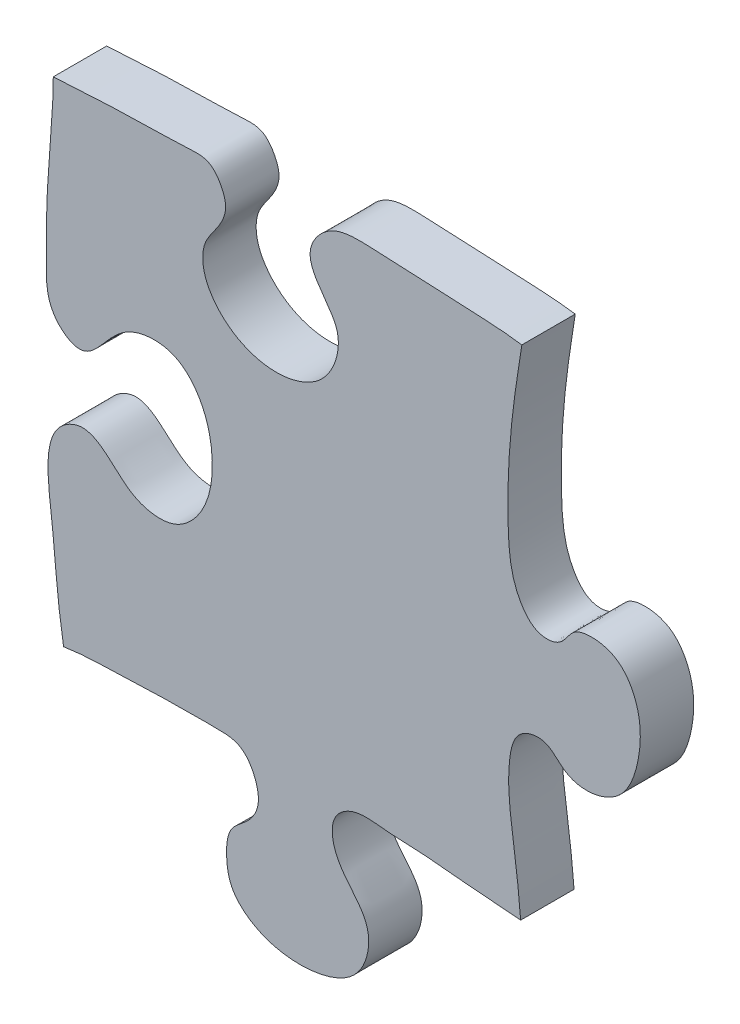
ISO-10303-21;
HEADER;
FILE_DESCRIPTION(('STEP AP214'),'2;1');
FILE_NAME('part.step','',(''),(''),'','','');
FILE_SCHEMA(('AUTOMOTIVE_DESIGN { 1 0 10303 214 1 1 1 1 }'));
ENDSEC;
DATA;
#1=APPLICATION_CONTEXT('core data for automotive mechanical design processes');
#2=APPLICATION_PROTOCOL_DEFINITION('international standard','automotive_design',2000,#1);
#3=PRODUCT_CONTEXT('',#1,'mechanical');
#4=PRODUCT('Part','Part','',(#3));
#5=PRODUCT_RELATED_PRODUCT_CATEGORY('part','',(#4));
#6=PRODUCT_DEFINITION_FORMATION('','',#4);
#7=PRODUCT_DEFINITION_CONTEXT('part definition',#1,'design');
#8=PRODUCT_DEFINITION('design','',#6,#7);
#9=PRODUCT_DEFINITION_SHAPE('','',#8);
#10=(LENGTH_UNIT() NAMED_UNIT(*) SI_UNIT(.MILLI.,.METRE.));
#11=(NAMED_UNIT(*) PLANE_ANGLE_UNIT() SI_UNIT($,.RADIAN.));
#12=(NAMED_UNIT(*) SI_UNIT($,.STERADIAN.) SOLID_ANGLE_UNIT());
#13=UNCERTAINTY_MEASURE_WITH_UNIT(LENGTH_MEASURE(1.E-05),#10,'distance_accuracy_value','');
#14=(GEOMETRIC_REPRESENTATION_CONTEXT(3) GLOBAL_UNCERTAINTY_ASSIGNED_CONTEXT((#13)) GLOBAL_UNIT_ASSIGNED_CONTEXT((#10,
#11,#12)) REPRESENTATION_CONTEXT('',''));
#15=CARTESIAN_POINT('',(0.,0.,0.));
#16=DIRECTION('',(0.,0.,1.));
#17=DIRECTION('',(1.,0.,0.));
#18=AXIS2_PLACEMENT_3D('',#15,#16,#17);
#19=CARTESIAN_POINT('',(164.700455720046,356.,-0.00999999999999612));
#20=CARTESIAN_POINT('',(166.684488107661,335.198470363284,-0.00999999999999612));
#21=CARTESIAN_POINT('',(165.501961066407,316.54844325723,-0.00999999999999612));
#22=CARTESIAN_POINT('',(164.960386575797,287.97241381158,-0.00999999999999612));
#23=CARTESIAN_POINT('',(152.647306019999,285.390744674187,-0.00999999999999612));
#24=CARTESIAN_POINT('',(146.755099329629,295.454986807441,-0.00999999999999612));
#25=CARTESIAN_POINT('',(133.057911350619,298.241097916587,-0.00999999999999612));
#26=CARTESIAN_POINT('',(118.543117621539,289.096389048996,-0.00999999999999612));
#27=CARTESIAN_POINT('',(110.066069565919,270.786201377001,-0.00999999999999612));
#28=CARTESIAN_POINT('',(115.81886117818,249.01949577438,-0.00999999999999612));
#29=CARTESIAN_POINT('',(132.43055469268,243.861484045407,-0.00999999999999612));
#30=CARTESIAN_POINT('',(145.190771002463,247.721589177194,-0.00999999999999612));
#31=CARTESIAN_POINT('',(150.073688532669,259.755128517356,-0.00999999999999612));
#32=CARTESIAN_POINT('',(164.873456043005,258.011209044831,-0.00999999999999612));
#33=CARTESIAN_POINT('',(166.852874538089,244.914449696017,-0.00999999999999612));
#34=CARTESIAN_POINT('',(165.64887314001,235.496089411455,-0.00999999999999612));
#35=CARTESIAN_POINT('',(164.287273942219,218.693357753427,-0.00999999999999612));
#36=CARTESIAN_POINT('',(162.190296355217,197.368034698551,-0.00999999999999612));
#37=CARTESIAN_POINT('',(156.3242571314,163.987545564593,-0.00999999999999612));
#38=CARTESIAN_POINT('',(154.411282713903,133.17643128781,-0.00999999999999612));
#39=CARTESIAN_POINT('',(156.534624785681,107.79955112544,-0.00999999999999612));
#40=CARTESIAN_POINT('',(165.683431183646,96.7362595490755,-0.00999999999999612));
#41=CARTESIAN_POINT('',(175.741034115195,97.7165246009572,-0.00999999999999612));
#42=CARTESIAN_POINT('',(178.913476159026,105.433342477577,-0.00999999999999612));
#43=CARTESIAN_POINT('',(187.788546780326,107.088038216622,-0.00999999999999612));
#44=CARTESIAN_POINT('',(196.945345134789,104.662624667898,-0.00999999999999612));
#45=CARTESIAN_POINT('',(205.29981235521,92.5405980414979,-0.00999999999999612));
#46=CARTESIAN_POINT('',(205.41693478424,76.2178133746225,-0.00999999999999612));
#47=CARTESIAN_POINT('',(199.239540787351,59.8870096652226,-0.00999999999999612));
#48=CARTESIAN_POINT('',(186.871281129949,54.774238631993,-0.00999999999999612));
#49=CARTESIAN_POINT('',(176.156697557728,56.844920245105,-0.00999999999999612));
#50=CARTESIAN_POINT('',(170.099360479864,65.2771221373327,-0.00999999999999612));
#51=CARTESIAN_POINT('',(157.970826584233,62.7514417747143,-0.00999999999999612));
#52=CARTESIAN_POINT('',(154.504441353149,46.6972732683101,-0.00999999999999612));
#53=CARTESIAN_POINT('',(156.826886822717,28.5222575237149,-0.00999999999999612));
#54=CARTESIAN_POINT('',(160.951813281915,-0.904965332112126,-0.00999999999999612));
#55=CARTESIAN_POINT('',(160.817443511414,-23.2712614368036,-0.00999999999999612));
#56=CARTESIAN_POINT('',(159.515162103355,-48.5242453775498,-0.00999999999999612));
#57=CARTESIAN_POINT('',(159.855435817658,-66.2012023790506,-0.00999999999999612));
#58=CARTESIAN_POINT('',(174.098925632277,-64.1326131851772,-0.00999999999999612));
#59=CARTESIAN_POINT('',(178.558905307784,-57.1982656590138,-0.00999999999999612));
#60=CARTESIAN_POINT('',(189.170801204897,-53.4758485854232,-0.00999999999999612));
#61=CARTESIAN_POINT('',(204.121791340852,-56.9229006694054,-0.00999999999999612));
#62=CARTESIAN_POINT('',(214.382314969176,-74.3254117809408,-0.00999999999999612));
#63=CARTESIAN_POINT('',(212.434433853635,-94.56819618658,-0.00999999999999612));
#64=CARTESIAN_POINT('',(198.400882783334,-105.927100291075,-0.00999999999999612));
#65=CARTESIAN_POINT('',(183.864051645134,-103.318484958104,-0.00999999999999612));
#66=CARTESIAN_POINT('',(177.484460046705,-92.9196706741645,-0.00999999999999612));
#67=CARTESIAN_POINT('',(166.612136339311,-90.3684772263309,-0.00999999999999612));
#68=CARTESIAN_POINT('',(160.072685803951,-95.573386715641,-0.00999999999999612));
#69=CARTESIAN_POINT('',(159.605088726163,-111.518801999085,-0.00999999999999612));
#70=CARTESIAN_POINT('',(161.971531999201,-132.152629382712,-0.00999999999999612));
#71=CARTESIAN_POINT('',(165.531009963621,-165.300059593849,-0.00999999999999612));
#72=CARTESIAN_POINT('',(167.927544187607,-195.365052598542,-0.00999999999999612));
#73=CARTESIAN_POINT('',(172.57489134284,-240.687787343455,-0.00999999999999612));
#74=CARTESIAN_POINT('',(151.998880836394,-237.677540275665,-0.00999999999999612));
#75=CARTESIAN_POINT('',(144.556929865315,-230.426442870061,-0.00999999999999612));
#76=CARTESIAN_POINT('',(127.822205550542,-229.966972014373,-0.00999999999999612));
#77=CARTESIAN_POINT('',(119.338975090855,-241.300441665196,-0.00999999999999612));
#78=CARTESIAN_POINT('',(116.55363668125,-259.024274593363,-0.00999999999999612));
#79=CARTESIAN_POINT('',(116.920126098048,-276.665079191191,-0.00999999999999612));
#80=CARTESIAN_POINT('',(139.807593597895,-286.808161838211,-0.00999999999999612));
#81=CARTESIAN_POINT('',(149.426451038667,-271.120437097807,-0.00999999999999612));
#82=CARTESIAN_POINT('',(164.833722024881,-276.098774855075,-0.00999999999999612));
#83=CARTESIAN_POINT('',(167.534498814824,-298.611176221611,-0.00999999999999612));
#84=CARTESIAN_POINT('',(167.66539945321,-324.44648435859,-0.00999999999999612));
#85=CARTESIAN_POINT('',(167.206886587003,-345.801767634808,-0.00999999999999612));
#86=CARTESIAN_POINT('',(167.126415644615,-356.,-0.00999999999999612));
#87=B_SPLINE_CURVE_WITH_KNOTS('',3,(#19,#20,#21,#22,#23,#24,#25,#26,#27,#28,#29,#30,#31,#32,#33,
#34,#35,#36,#37,#38,#39,#40,#41,#42,#43,#44,#45,#46,#47,#48,#49,#50,#51,#52,#53,#54,#55,#56,#57,
#58,#59,#60,#61,#62,#63,#64,#65,#66,#67,#68,#69,#70,#71,#72,#73,#74,#75,#76,#77,#78,#79,#80,#81,
#82,#83,#84,#85,#86),.UNSPECIFIED.,.F.,.F.,(4,1,1,1,1,1,1,1,1,1,1,1,1,1,1,1,1,1,1,1,1,1,1,1,1,1,
1,1,1,1,1,1,1,1,1,1,1,1,1,1,1,1,1,1,1,1,1,1,1,1,1,1,1,1,1,1,1,1,1,1,1,1,1,1,1,4),(0.,
0.0528861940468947,0.0611638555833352,0.0696733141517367,0.078438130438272,0.090018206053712,
0.103675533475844,0.122333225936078,0.142560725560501,0.155895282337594,0.165515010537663,
0.176439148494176,0.187171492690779,0.194785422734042,0.209132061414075,0.213814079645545,
0.241605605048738,0.267229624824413,0.306753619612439,0.326390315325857,0.335466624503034,
0.342457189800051,0.349640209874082,0.355564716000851,0.365339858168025,0.374043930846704,
0.393709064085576,0.408072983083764,0.418687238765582,0.427525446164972,0.43602306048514,
0.444515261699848,0.454494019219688,0.476412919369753,0.496275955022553,0.534624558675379,
0.541144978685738,0.561480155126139,0.567662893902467,0.574392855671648,0.583113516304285,
0.596680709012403,0.612912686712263,0.634082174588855,0.646626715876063,0.657822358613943,
0.669754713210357,0.678210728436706,0.685129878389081,0.689092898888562,0.71784093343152,
0.747115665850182,0.77522808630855,0.815611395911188,0.819725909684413,0.828398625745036,
0.84335213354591,0.85870373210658,0.863219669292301,0.888511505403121,0.901615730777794,
0.918667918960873,0.92637935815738,0.939283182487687,0.973955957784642,1.),.UNSPECIFIED.);
#88=DIRECTION('',(0.,0.,1.));
#89=VECTOR('',#88,1.);
#90=SURFACE_OF_LINEAR_EXTRUSION('',#87,#89);
#91=CARTESIAN_POINT('',(164.700455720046,356.,20.));
#92=CARTESIAN_POINT('',(166.684488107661,335.198470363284,20.));
#93=CARTESIAN_POINT('',(165.501961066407,316.54844325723,20.));
#94=CARTESIAN_POINT('',(164.960386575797,287.97241381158,20.));
#95=CARTESIAN_POINT('',(152.647306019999,285.390744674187,20.));
#96=CARTESIAN_POINT('',(146.755099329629,295.454986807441,20.));
#97=CARTESIAN_POINT('',(133.057911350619,298.241097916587,20.));
#98=CARTESIAN_POINT('',(118.543117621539,289.096389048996,20.));
#99=CARTESIAN_POINT('',(110.066069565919,270.786201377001,20.));
#100=CARTESIAN_POINT('',(115.81886117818,249.01949577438,20.));
#101=CARTESIAN_POINT('',(132.43055469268,243.861484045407,20.));
#102=CARTESIAN_POINT('',(145.190771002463,247.721589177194,20.));
#103=CARTESIAN_POINT('',(150.073688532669,259.755128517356,20.));
#104=CARTESIAN_POINT('',(164.873456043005,258.011209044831,20.));
#105=CARTESIAN_POINT('',(166.852874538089,244.914449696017,20.));
#106=CARTESIAN_POINT('',(165.64887314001,235.496089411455,20.));
#107=CARTESIAN_POINT('',(164.287273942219,218.693357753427,20.));
#108=CARTESIAN_POINT('',(162.190296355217,197.368034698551,20.));
#109=CARTESIAN_POINT('',(156.3242571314,163.987545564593,20.));
#110=CARTESIAN_POINT('',(154.411282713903,133.17643128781,20.));
#111=CARTESIAN_POINT('',(156.534624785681,107.79955112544,20.));
#112=CARTESIAN_POINT('',(165.683431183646,96.7362595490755,20.));
#113=CARTESIAN_POINT('',(175.741034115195,97.7165246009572,20.));
#114=CARTESIAN_POINT('',(178.913476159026,105.433342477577,20.));
#115=CARTESIAN_POINT('',(187.788546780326,107.088038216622,20.));
#116=CARTESIAN_POINT('',(196.945345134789,104.662624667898,20.));
#117=CARTESIAN_POINT('',(205.29981235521,92.5405980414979,20.));
#118=CARTESIAN_POINT('',(205.41693478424,76.2178133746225,20.));
#119=CARTESIAN_POINT('',(199.239540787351,59.8870096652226,20.));
#120=CARTESIAN_POINT('',(186.871281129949,54.774238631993,20.));
#121=CARTESIAN_POINT('',(176.156697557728,56.844920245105,20.));
#122=CARTESIAN_POINT('',(170.099360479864,65.2771221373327,20.));
#123=CARTESIAN_POINT('',(157.970826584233,62.7514417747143,20.));
#124=CARTESIAN_POINT('',(154.504441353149,46.6972732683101,20.));
#125=CARTESIAN_POINT('',(156.826886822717,28.5222575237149,20.));
#126=CARTESIAN_POINT('',(160.951813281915,-0.904965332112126,20.));
#127=CARTESIAN_POINT('',(160.817443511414,-23.2712614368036,20.));
#128=CARTESIAN_POINT('',(159.515162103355,-48.5242453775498,20.));
#129=CARTESIAN_POINT('',(159.855435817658,-66.2012023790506,20.));
#130=CARTESIAN_POINT('',(174.098925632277,-64.1326131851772,20.));
#131=CARTESIAN_POINT('',(178.558905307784,-57.1982656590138,20.));
#132=CARTESIAN_POINT('',(189.170801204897,-53.4758485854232,20.));
#133=CARTESIAN_POINT('',(204.121791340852,-56.9229006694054,20.));
#134=CARTESIAN_POINT('',(214.382314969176,-74.3254117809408,20.));
#135=CARTESIAN_POINT('',(212.434433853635,-94.56819618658,20.));
#136=CARTESIAN_POINT('',(198.400882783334,-105.927100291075,20.));
#137=CARTESIAN_POINT('',(183.864051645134,-103.318484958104,20.));
#138=CARTESIAN_POINT('',(177.484460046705,-92.9196706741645,20.));
#139=CARTESIAN_POINT('',(166.612136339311,-90.3684772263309,20.));
#140=CARTESIAN_POINT('',(160.072685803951,-95.573386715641,20.));
#141=CARTESIAN_POINT('',(159.605088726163,-111.518801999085,20.));
#142=CARTESIAN_POINT('',(161.971531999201,-132.152629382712,20.));
#143=CARTESIAN_POINT('',(165.531009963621,-165.300059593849,20.));
#144=CARTESIAN_POINT('',(167.927544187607,-195.365052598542,20.));
#145=CARTESIAN_POINT('',(172.57489134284,-240.687787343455,20.));
#146=CARTESIAN_POINT('',(151.998880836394,-237.677540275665,20.));
#147=CARTESIAN_POINT('',(144.556929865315,-230.426442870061,20.));
#148=CARTESIAN_POINT('',(127.822205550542,-229.966972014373,20.));
#149=CARTESIAN_POINT('',(119.338975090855,-241.300441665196,20.));
#150=CARTESIAN_POINT('',(116.55363668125,-259.024274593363,20.));
#151=CARTESIAN_POINT('',(116.920126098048,-276.665079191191,20.));
#152=CARTESIAN_POINT('',(139.807593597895,-286.808161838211,20.));
#153=CARTESIAN_POINT('',(149.426451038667,-271.120437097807,20.));
#154=CARTESIAN_POINT('',(164.833722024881,-276.098774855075,20.));
#155=CARTESIAN_POINT('',(167.534498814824,-298.611176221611,20.));
#156=CARTESIAN_POINT('',(167.66539945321,-324.44648435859,20.));
#157=CARTESIAN_POINT('',(167.206886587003,-345.801767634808,20.));
#158=CARTESIAN_POINT('',(167.126415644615,-356.,20.));
#159=B_SPLINE_CURVE_WITH_KNOTS('',3,(#91,#92,#93,#94,#95,#96,#97,#98,#99,#100,#101,#102,#103,
#104,#105,#106,#107,#108,#109,#110,#111,#112,#113,#114,#115,#116,#117,#118,#119,#120,#121,#122,
#123,#124,#125,#126,#127,#128,#129,#130,#131,#132,#133,#134,#135,#136,#137,#138,#139,#140,#141,
#142,#143,#144,#145,#146,#147,#148,#149,#150,#151,#152,#153,#154,#155,#156,#157,#158),
.UNSPECIFIED.,.F.,.F.,(4,1,1,1,1,1,1,1,1,1,1,1,1,1,1,1,1,1,1,1,1,1,1,1,1,1,1,1,1,1,1,1,1,1,1,1,
1,1,1,1,1,1,1,1,1,1,1,1,1,1,1,1,1,1,1,1,1,1,1,1,1,1,1,1,1,4),(0.,0.0528861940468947,
0.0611638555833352,0.0696733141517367,0.078438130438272,0.090018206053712,0.103675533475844,
0.122333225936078,0.142560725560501,0.155895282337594,0.165515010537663,0.176439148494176,
0.187171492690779,0.194785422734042,0.209132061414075,0.213814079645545,0.241605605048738,
0.267229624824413,0.306753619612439,0.326390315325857,0.335466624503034,0.342457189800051,
0.349640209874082,0.355564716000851,0.365339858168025,0.374043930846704,0.393709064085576,
0.408072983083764,0.418687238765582,0.427525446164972,0.43602306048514,0.444515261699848,
0.454494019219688,0.476412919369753,0.496275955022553,0.534624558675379,0.541144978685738,
0.561480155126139,0.567662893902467,0.574392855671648,0.583113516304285,0.596680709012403,
0.612912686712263,0.634082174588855,0.646626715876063,0.657822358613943,0.669754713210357,
0.678210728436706,0.685129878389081,0.689092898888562,0.71784093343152,0.747115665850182,
0.77522808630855,0.815611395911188,0.819725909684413,0.828398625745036,0.84335213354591,
0.85870373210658,0.863219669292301,0.888511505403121,0.901615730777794,0.918667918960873,
0.92637935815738,0.939283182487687,0.973955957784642,1.),.UNSPECIFIED.);
#160=CARTESIAN_POINT('',(160.461892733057,188.122695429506,20.));
#161=VERTEX_POINT('',#160);
#162=CARTESIAN_POINT('',(160.020895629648,1.33334492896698,20.));
#163=VERTEX_POINT('',#162);
#164=EDGE_CURVE('E89',#161,#163,#159,.T.);
#165=ORIENTED_EDGE('',*,*,#164,.T.);
#166=DIRECTION('',(0.,0.,1.));
#167=VECTOR('',#166,1.);
#168=CARTESIAN_POINT('',(160.020895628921,1.33334492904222,-0.00999999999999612));
#169=LINE('',#168,#167);
#170=CARTESIAN_POINT('',(160.020895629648,1.33334492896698,0.));
#171=VERTEX_POINT('',#170);
#172=EDGE_CURVE('E79',#163,#171,#169,.F.);
#173=ORIENTED_EDGE('',*,*,#172,.T.);
#174=CARTESIAN_POINT('',(164.700455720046,356.,0.));
#175=CARTESIAN_POINT('',(166.684488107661,335.198470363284,0.));
#176=CARTESIAN_POINT('',(165.501961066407,316.54844325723,0.));
#177=CARTESIAN_POINT('',(164.960386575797,287.97241381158,0.));
#178=CARTESIAN_POINT('',(152.647306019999,285.390744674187,0.));
#179=CARTESIAN_POINT('',(146.755099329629,295.454986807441,0.));
#180=CARTESIAN_POINT('',(133.057911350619,298.241097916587,0.));
#181=CARTESIAN_POINT('',(118.543117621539,289.096389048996,0.));
#182=CARTESIAN_POINT('',(110.066069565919,270.786201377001,0.));
#183=CARTESIAN_POINT('',(115.81886117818,249.01949577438,0.));
#184=CARTESIAN_POINT('',(132.43055469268,243.861484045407,0.));
#185=CARTESIAN_POINT('',(145.190771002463,247.721589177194,0.));
#186=CARTESIAN_POINT('',(150.073688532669,259.755128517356,0.));
#187=CARTESIAN_POINT('',(164.873456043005,258.011209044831,0.));
#188=CARTESIAN_POINT('',(166.852874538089,244.914449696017,0.));
#189=CARTESIAN_POINT('',(165.64887314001,235.496089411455,0.));
#190=CARTESIAN_POINT('',(164.287273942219,218.693357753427,0.));
#191=CARTESIAN_POINT('',(162.190296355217,197.368034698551,0.));
#192=CARTESIAN_POINT('',(156.3242571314,163.987545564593,0.));
#193=CARTESIAN_POINT('',(154.411282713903,133.17643128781,0.));
#194=CARTESIAN_POINT('',(156.534624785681,107.79955112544,0.));
#195=CARTESIAN_POINT('',(165.683431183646,96.7362595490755,0.));
#196=CARTESIAN_POINT('',(175.741034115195,97.7165246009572,0.));
#197=CARTESIAN_POINT('',(178.913476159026,105.433342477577,0.));
#198=CARTESIAN_POINT('',(187.788546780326,107.088038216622,0.));
#199=CARTESIAN_POINT('',(196.945345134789,104.662624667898,0.));
#200=CARTESIAN_POINT('',(205.29981235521,92.5405980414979,0.));
#201=CARTESIAN_POINT('',(205.41693478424,76.2178133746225,0.));
#202=CARTESIAN_POINT('',(199.239540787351,59.8870096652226,0.));
#203=CARTESIAN_POINT('',(186.871281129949,54.774238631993,0.));
#204=CARTESIAN_POINT('',(176.156697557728,56.844920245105,0.));
#205=CARTESIAN_POINT('',(170.099360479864,65.2771221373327,0.));
#206=CARTESIAN_POINT('',(157.970826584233,62.7514417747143,0.));
#207=CARTESIAN_POINT('',(154.504441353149,46.6972732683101,0.));
#208=CARTESIAN_POINT('',(156.826886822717,28.5222575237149,0.));
#209=CARTESIAN_POINT('',(160.951813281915,-0.904965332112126,0.));
#210=CARTESIAN_POINT('',(160.817443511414,-23.2712614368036,0.));
#211=CARTESIAN_POINT('',(159.515162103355,-48.5242453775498,0.));
#212=CARTESIAN_POINT('',(159.855435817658,-66.2012023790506,0.));
#213=CARTESIAN_POINT('',(174.098925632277,-64.1326131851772,0.));
#214=CARTESIAN_POINT('',(178.558905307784,-57.1982656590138,0.));
#215=CARTESIAN_POINT('',(189.170801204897,-53.4758485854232,0.));
#216=CARTESIAN_POINT('',(204.121791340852,-56.9229006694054,0.));
#217=CARTESIAN_POINT('',(214.382314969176,-74.3254117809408,0.));
#218=CARTESIAN_POINT('',(212.434433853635,-94.56819618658,0.));
#219=CARTESIAN_POINT('',(198.400882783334,-105.927100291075,0.));
#220=CARTESIAN_POINT('',(183.864051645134,-103.318484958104,0.));
#221=CARTESIAN_POINT('',(177.484460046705,-92.9196706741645,0.));
#222=CARTESIAN_POINT('',(166.612136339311,-90.3684772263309,0.));
#223=CARTESIAN_POINT('',(160.072685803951,-95.573386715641,0.));
#224=CARTESIAN_POINT('',(159.605088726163,-111.518801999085,0.));
#225=CARTESIAN_POINT('',(161.971531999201,-132.152629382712,0.));
#226=CARTESIAN_POINT('',(165.531009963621,-165.300059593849,0.));
#227=CARTESIAN_POINT('',(167.927544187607,-195.365052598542,0.));
#228=CARTESIAN_POINT('',(172.57489134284,-240.687787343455,0.));
#229=CARTESIAN_POINT('',(151.998880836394,-237.677540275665,0.));
#230=CARTESIAN_POINT('',(144.556929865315,-230.426442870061,0.));
#231=CARTESIAN_POINT('',(127.822205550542,-229.966972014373,0.));
#232=CARTESIAN_POINT('',(119.338975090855,-241.300441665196,0.));
#233=CARTESIAN_POINT('',(116.55363668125,-259.024274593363,0.));
#234=CARTESIAN_POINT('',(116.920126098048,-276.665079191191,0.));
#235=CARTESIAN_POINT('',(139.807593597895,-286.808161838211,0.));
#236=CARTESIAN_POINT('',(149.426451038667,-271.120437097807,0.));
#237=CARTESIAN_POINT('',(164.833722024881,-276.098774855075,0.));
#238=CARTESIAN_POINT('',(167.534498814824,-298.611176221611,0.));
#239=CARTESIAN_POINT('',(167.66539945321,-324.44648435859,0.));
#240=CARTESIAN_POINT('',(167.206886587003,-345.801767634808,0.));
#241=CARTESIAN_POINT('',(167.126415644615,-356.,0.));
#242=B_SPLINE_CURVE_WITH_KNOTS('',3,(#174,#175,#176,#177,#178,#179,#180,#181,#182,#183,#184,
#185,#186,#187,#188,#189,#190,#191,#192,#193,#194,#195,#196,#197,#198,#199,#200,#201,#202,#203,
#204,#205,#206,#207,#208,#209,#210,#211,#212,#213,#214,#215,#216,#217,#218,#219,#220,#221,#222,
#223,#224,#225,#226,#227,#228,#229,#230,#231,#232,#233,#234,#235,#236,#237,#238,#239,#240,#241),
.UNSPECIFIED.,.F.,.F.,(4,1,1,1,1,1,1,1,1,1,1,1,1,1,1,1,1,1,1,1,1,1,1,1,1,1,1,1,1,1,1,1,1,1,1,1,
1,1,1,1,1,1,1,1,1,1,1,1,1,1,1,1,1,1,1,1,1,1,1,1,1,1,1,1,1,4),(0.,0.0528861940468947,
0.0611638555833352,0.0696733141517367,0.078438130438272,0.090018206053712,0.103675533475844,
0.122333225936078,0.142560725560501,0.155895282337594,0.165515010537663,0.176439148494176,
0.187171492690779,0.194785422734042,0.209132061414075,0.213814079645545,0.241605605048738,
0.267229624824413,0.306753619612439,0.326390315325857,0.335466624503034,0.342457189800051,
0.349640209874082,0.355564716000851,0.365339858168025,0.374043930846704,0.393709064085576,
0.408072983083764,0.418687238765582,0.427525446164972,0.43602306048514,0.444515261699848,
0.454494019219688,0.476412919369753,0.496275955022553,0.534624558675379,0.541144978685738,
0.561480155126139,0.567662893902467,0.574392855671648,0.583113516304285,0.596680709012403,
0.612912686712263,0.634082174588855,0.646626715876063,0.657822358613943,0.669754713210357,
0.678210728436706,0.685129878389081,0.689092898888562,0.71784093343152,0.747115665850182,
0.77522808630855,0.815611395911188,0.819725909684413,0.828398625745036,0.84335213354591,
0.85870373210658,0.863219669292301,0.888511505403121,0.901615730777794,0.918667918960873,
0.92637935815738,0.939283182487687,0.973955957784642,1.),.UNSPECIFIED.);
#243=CARTESIAN_POINT('',(160.461892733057,188.122695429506,0.));
#244=VERTEX_POINT('',#243);
#245=EDGE_CURVE('E116',#244,#171,#242,.T.);
#246=ORIENTED_EDGE('',*,*,#245,.F.);
#247=DIRECTION('',(0.,0.,1.));
#248=VECTOR('',#247,1.);
#249=CARTESIAN_POINT('',(160.461892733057,188.122695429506,-0.00999999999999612));
#250=LINE('',#249,#248);
#251=EDGE_CURVE('E90',#161,#244,#250,.F.);
#252=ORIENTED_EDGE('',*,*,#251,.F.);
#253=EDGE_LOOP('',(#165,#173,#246,#252));
#254=FACE_BOUND('',#253,.T.);
#255=ADVANCED_FACE('F34',(#254),#90,.F.);
#256=CARTESIAN_POINT('',(-9.39078729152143,356.,-0.00999999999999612));
#257=CARTESIAN_POINT('',(-10.6420004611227,342.109118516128,-0.00999999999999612));
#258=CARTESIAN_POINT('',(-14.6613121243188,319.56927935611,-0.00999999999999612));
#259=CARTESIAN_POINT('',(-17.4473947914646,293.08555207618,-0.00999999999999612));
#260=CARTESIAN_POINT('',(-13.8884373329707,273.667988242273,-0.00999999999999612));
#261=CARTESIAN_POINT('',(-1.07625820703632,271.397705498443,-0.00999999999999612));
#262=CARTESIAN_POINT('',(5.29309239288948,278.450722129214,-0.00999999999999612));
#263=CARTESIAN_POINT('',(14.9258759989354,283.741247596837,-0.00999999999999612));
#264=CARTESIAN_POINT('',(28.790892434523,278.335723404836,-0.00999999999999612));
#265=CARTESIAN_POINT('',(34.7382562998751,261.206713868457,-0.00999999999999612));
#266=CARTESIAN_POINT('',(33.1132905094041,240.122633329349,-0.00999999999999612));
#267=CARTESIAN_POINT('',(14.6676977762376,229.968331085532,-0.00999999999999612));
#268=CARTESIAN_POINT('',(3.42611827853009,235.442407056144,-0.00999999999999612));
#269=CARTESIAN_POINT('',(-2.96249564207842,240.393740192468,-0.00999999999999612));
#270=CARTESIAN_POINT('',(-18.0780076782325,240.138784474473,-0.00999999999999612));
#271=CARTESIAN_POINT('',(-18.5399667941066,222.992463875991,-0.00999999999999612));
#272=CARTESIAN_POINT('',(-17.4385931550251,202.827665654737,-0.00999999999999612));
#273=CARTESIAN_POINT('',(-14.0858554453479,190.221137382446,-0.00999999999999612));
#274=CARTESIAN_POINT('',(-15.5193743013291,175.136568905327,-0.00999999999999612));
#275=CARTESIAN_POINT('',(-16.6888175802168,157.648124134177,-0.00999999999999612));
#276=CARTESIAN_POINT('',(-17.7707660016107,144.240131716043,-0.00999999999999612));
#277=CARTESIAN_POINT('',(-17.3940925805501,124.109890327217,-0.00999999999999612));
#278=CARTESIAN_POINT('',(-18.6861496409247,110.985540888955,-0.00999999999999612));
#279=CARTESIAN_POINT('',(-3.94695866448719,101.126063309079,-0.00999999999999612));
#280=CARTESIAN_POINT('',(4.50824278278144,111.148466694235,-0.00999999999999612));
#281=CARTESIAN_POINT('',(13.1578407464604,120.870763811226,-0.00999999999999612));
#282=CARTESIAN_POINT('',(29.968112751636,122.314288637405,-0.00999999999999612));
#283=CARTESIAN_POINT('',(40.7223803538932,110.783826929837,-0.00999999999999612));
#284=CARTESIAN_POINT('',(45.7909417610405,94.3968136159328,-0.00999999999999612));
#285=CARTESIAN_POINT('',(43.9390810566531,75.8787758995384,-0.00999999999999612));
#286=CARTESIAN_POINT('',(30.503103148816,62.5847389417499,-0.00999999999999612));
#287=CARTESIAN_POINT('',(14.6986660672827,64.8647821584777,-0.00999999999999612));
#288=CARTESIAN_POINT('',(6.48631275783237,74.2887035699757,-0.00999999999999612));
#289=CARTESIAN_POINT('',(-2.74495882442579,80.3019272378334,-0.00999999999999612));
#290=CARTESIAN_POINT('',(-19.8840521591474,73.8019115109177,-0.00999999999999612));
#291=CARTESIAN_POINT('',(-15.1166354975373,44.269693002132,-0.00999999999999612));
#292=CARTESIAN_POINT('',(-13.5094217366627,17.7920418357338,-0.00999999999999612));
#293=CARTESIAN_POINT('',(-10.2430798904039,-1.06342782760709,-0.00999999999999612));
#294=CARTESIAN_POINT('',(-6.15123504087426,-23.5391381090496,-0.00999999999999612));
#295=CARTESIAN_POINT('',(-4.12992604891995,-48.8436757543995,-0.00999999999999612));
#296=CARTESIAN_POINT('',(-23.2142462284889,-47.7574601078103,-0.00999999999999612));
#297=CARTESIAN_POINT('',(-30.0018234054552,-40.5423137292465,-0.00999999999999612));
#298=CARTESIAN_POINT('',(-42.7528213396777,-39.1853410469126,-0.00999999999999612));
#299=CARTESIAN_POINT('',(-57.5092962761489,-47.8418744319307,-0.00999999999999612));
#300=CARTESIAN_POINT('',(-60.2210733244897,-67.5138769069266,-0.00999999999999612));
#301=CARTESIAN_POINT('',(-54.0018378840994,-88.1567638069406,-0.00999999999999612));
#302=CARTESIAN_POINT('',(-33.5101255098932,-90.2818581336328,-0.00999999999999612));
#303=CARTESIAN_POINT('',(-26.938266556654,-78.8436195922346,-0.00999999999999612));
#304=CARTESIAN_POINT('',(-16.0575989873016,-79.9605650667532,-0.00999999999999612));
#305=CARTESIAN_POINT('',(-9.29054500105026,-89.9843542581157,-0.00999999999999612));
#306=CARTESIAN_POINT('',(-9.26037942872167,-106.547726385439,-0.00999999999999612));
#307=CARTESIAN_POINT('',(-10.8655976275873,-129.908253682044,-0.00999999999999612));
#308=CARTESIAN_POINT('',(-18.080355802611,-155.05589418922,-0.00999999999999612));
#309=CARTESIAN_POINT('',(-15.5015350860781,-180.564325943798,-0.00999999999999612));
#310=CARTESIAN_POINT('',(-13.4534563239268,-202.72625863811,-0.00999999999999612));
#311=CARTESIAN_POINT('',(-13.0721771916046,-222.761537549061,-0.00999999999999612));
#312=CARTESIAN_POINT('',(-18.0801009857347,-237.162246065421,-0.00999999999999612));
#313=CARTESIAN_POINT('',(-28.3640065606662,-243.264641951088,-0.00999999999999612));
#314=CARTESIAN_POINT('',(-35.3195309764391,-234.565632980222,-0.00999999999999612));
#315=CARTESIAN_POINT('',(-45.5220607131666,-230.442721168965,-0.00999999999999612));
#316=CARTESIAN_POINT('',(-58.2826152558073,-236.227844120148,-0.00999999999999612));
#317=CARTESIAN_POINT('',(-63.2505187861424,-252.690663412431,-0.00999999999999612));
#318=CARTESIAN_POINT('',(-62.4331763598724,-269.758175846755,-0.00999999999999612));
#319=CARTESIAN_POINT('',(-51.5712190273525,-281.475483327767,-0.00999999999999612));
#320=CARTESIAN_POINT('',(-36.6120763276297,-283.519302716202,-0.00999999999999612));
#321=CARTESIAN_POINT('',(-27.825780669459,-270.933950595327,-0.00999999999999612));
#322=CARTESIAN_POINT('',(-10.9923291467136,-277.705324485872,-0.00999999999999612));
#323=CARTESIAN_POINT('',(-14.9884890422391,-312.557066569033,-0.00999999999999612));
#324=CARTESIAN_POINT('',(-14.8626828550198,-333.640060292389,-0.00999999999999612));
#325=CARTESIAN_POINT('',(-17.0261941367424,-356.,-0.00999999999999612));
#326=B_SPLINE_CURVE_WITH_KNOTS('',3,(#256,#257,#258,#259,#260,#261,#262,#263,#264,#265,#266,
#267,#268,#269,#270,#271,#272,#273,#274,#275,#276,#277,#278,#279,#280,#281,#282,#283,#284,#285,
#286,#287,#288,#289,#290,#291,#292,#293,#294,#295,#296,#297,#298,#299,#300,#301,#302,#303,#304,
#305,#306,#307,#308,#309,#310,#311,#312,#313,#314,#315,#316,#317,#318,#319,#320,#321,#322,#323,
#324,#325),.UNSPECIFIED.,.F.,.F.,(4,1,1,1,1,1,1,1,1,1,1,1,1,1,1,1,1,1,1,1,1,1,1,1,1,1,1,1,1,1,1,
1,1,1,1,1,1,1,1,1,1,1,1,1,1,1,1,1,1,1,1,1,1,1,1,1,1,1,1,1,1,1,1,1,1,1,1,4),(0.,
0.0382435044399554,0.06014267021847,0.0759154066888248,0.0830880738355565,0.0898528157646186,
0.100420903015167,0.110971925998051,0.125303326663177,0.146622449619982,0.16313068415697,
0.171984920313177,0.178976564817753,0.184846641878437,0.208558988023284,0.213294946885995,
0.232206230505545,0.247690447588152,0.25282597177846,0.280146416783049,0.285652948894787,
0.304476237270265,0.313783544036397,0.32377706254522,0.334253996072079,0.350240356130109,
0.361652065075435,0.37428972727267,0.396319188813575,0.408299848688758,0.421251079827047,
0.43387737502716,0.442611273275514,0.448402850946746,0.478919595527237,0.50340807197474,
0.525599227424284,0.531488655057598,0.562302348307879,0.569309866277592,0.576593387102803,
0.588291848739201,0.600948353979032,0.618957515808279,0.638096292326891,0.652011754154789,
0.663601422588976,0.667955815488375,0.679319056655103,0.692000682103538,0.712742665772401,
0.742765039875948,0.761777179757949,0.781638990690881,0.803327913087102,0.815753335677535,
0.82139602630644,0.831491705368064,0.840302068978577,0.85029925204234,0.865053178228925,
0.884091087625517,0.893653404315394,0.906570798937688,0.918850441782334,0.928550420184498,
0.945628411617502,1.),.UNSPECIFIED.);
#327=DIRECTION('',(0.,0.,1.));
#328=VECTOR('',#327,1.);
#329=SURFACE_OF_LINEAR_EXTRUSION('',#326,#328);
#330=CARTESIAN_POINT('',(-9.39078729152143,356.,20.));
#331=CARTESIAN_POINT('',(-10.6420004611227,342.109118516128,20.));
#332=CARTESIAN_POINT('',(-14.6613121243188,319.56927935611,20.));
#333=CARTESIAN_POINT('',(-17.4473947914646,293.08555207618,20.));
#334=CARTESIAN_POINT('',(-13.8884373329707,273.667988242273,20.));
#335=CARTESIAN_POINT('',(-1.07625820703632,271.397705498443,20.));
#336=CARTESIAN_POINT('',(5.29309239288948,278.450722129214,20.));
#337=CARTESIAN_POINT('',(14.9258759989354,283.741247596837,20.));
#338=CARTESIAN_POINT('',(28.790892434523,278.335723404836,20.));
#339=CARTESIAN_POINT('',(34.7382562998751,261.206713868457,20.));
#340=CARTESIAN_POINT('',(33.1132905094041,240.122633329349,20.));
#341=CARTESIAN_POINT('',(14.6676977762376,229.968331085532,20.));
#342=CARTESIAN_POINT('',(3.42611827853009,235.442407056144,20.));
#343=CARTESIAN_POINT('',(-2.96249564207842,240.393740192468,20.));
#344=CARTESIAN_POINT('',(-18.0780076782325,240.138784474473,20.));
#345=CARTESIAN_POINT('',(-18.5399667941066,222.992463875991,20.));
#346=CARTESIAN_POINT('',(-17.4385931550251,202.827665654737,20.));
#347=CARTESIAN_POINT('',(-14.0858554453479,190.221137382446,20.));
#348=CARTESIAN_POINT('',(-15.5193743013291,175.136568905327,20.));
#349=CARTESIAN_POINT('',(-16.6888175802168,157.648124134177,20.));
#350=CARTESIAN_POINT('',(-17.7707660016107,144.240131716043,20.));
#351=CARTESIAN_POINT('',(-17.3940925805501,124.109890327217,20.));
#352=CARTESIAN_POINT('',(-18.6861496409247,110.985540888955,20.));
#353=CARTESIAN_POINT('',(-3.94695866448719,101.126063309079,20.));
#354=CARTESIAN_POINT('',(4.50824278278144,111.148466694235,20.));
#355=CARTESIAN_POINT('',(13.1578407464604,120.870763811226,20.));
#356=CARTESIAN_POINT('',(29.968112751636,122.314288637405,20.));
#357=CARTESIAN_POINT('',(40.7223803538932,110.783826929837,20.));
#358=CARTESIAN_POINT('',(45.7909417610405,94.3968136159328,20.));
#359=CARTESIAN_POINT('',(43.9390810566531,75.8787758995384,20.));
#360=CARTESIAN_POINT('',(30.503103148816,62.5847389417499,20.));
#361=CARTESIAN_POINT('',(14.6986660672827,64.8647821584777,20.));
#362=CARTESIAN_POINT('',(6.48631275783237,74.2887035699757,20.));
#363=CARTESIAN_POINT('',(-2.74495882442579,80.3019272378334,20.));
#364=CARTESIAN_POINT('',(-19.8840521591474,73.8019115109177,20.));
#365=CARTESIAN_POINT('',(-15.1166354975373,44.269693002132,20.));
#366=CARTESIAN_POINT('',(-13.5094217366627,17.7920418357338,20.));
#367=CARTESIAN_POINT('',(-10.2430798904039,-1.06342782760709,20.));
#368=CARTESIAN_POINT('',(-6.15123504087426,-23.5391381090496,20.));
#369=CARTESIAN_POINT('',(-4.12992604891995,-48.8436757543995,20.));
#370=CARTESIAN_POINT('',(-23.2142462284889,-47.7574601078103,20.));
#371=CARTESIAN_POINT('',(-30.0018234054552,-40.5423137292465,20.));
#372=CARTESIAN_POINT('',(-42.7528213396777,-39.1853410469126,20.));
#373=CARTESIAN_POINT('',(-57.5092962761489,-47.8418744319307,20.));
#374=CARTESIAN_POINT('',(-60.2210733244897,-67.5138769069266,20.));
#375=CARTESIAN_POINT('',(-54.0018378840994,-88.1567638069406,20.));
#376=CARTESIAN_POINT('',(-33.5101255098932,-90.2818581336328,20.));
#377=CARTESIAN_POINT('',(-26.938266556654,-78.8436195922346,20.));
#378=CARTESIAN_POINT('',(-16.0575989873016,-79.9605650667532,20.));
#379=CARTESIAN_POINT('',(-9.29054500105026,-89.9843542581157,20.));
#380=CARTESIAN_POINT('',(-9.26037942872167,-106.547726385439,20.));
#381=CARTESIAN_POINT('',(-10.8655976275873,-129.908253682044,20.));
#382=CARTESIAN_POINT('',(-18.080355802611,-155.05589418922,20.));
#383=CARTESIAN_POINT('',(-15.5015350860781,-180.564325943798,20.));
#384=CARTESIAN_POINT('',(-13.4534563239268,-202.72625863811,20.));
#385=CARTESIAN_POINT('',(-13.0721771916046,-222.761537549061,20.));
#386=CARTESIAN_POINT('',(-18.0801009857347,-237.162246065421,20.));
#387=CARTESIAN_POINT('',(-28.3640065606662,-243.264641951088,20.));
#388=CARTESIAN_POINT('',(-35.3195309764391,-234.565632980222,20.));
#389=CARTESIAN_POINT('',(-45.5220607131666,-230.442721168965,20.));
#390=CARTESIAN_POINT('',(-58.2826152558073,-236.227844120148,20.));
#391=CARTESIAN_POINT('',(-63.2505187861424,-252.690663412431,20.));
#392=CARTESIAN_POINT('',(-62.4331763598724,-269.758175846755,20.));
#393=CARTESIAN_POINT('',(-51.5712190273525,-281.475483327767,20.));
#394=CARTESIAN_POINT('',(-36.6120763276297,-283.519302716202,20.));
#395=CARTESIAN_POINT('',(-27.825780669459,-270.933950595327,20.));
#396=CARTESIAN_POINT('',(-10.9923291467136,-277.705324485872,20.));
#397=CARTESIAN_POINT('',(-14.9884890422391,-312.557066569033,20.));
#398=CARTESIAN_POINT('',(-14.8626828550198,-333.640060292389,20.));
#399=CARTESIAN_POINT('',(-17.0261941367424,-356.,20.));
#400=B_SPLINE_CURVE_WITH_KNOTS('',3,(#330,#331,#332,#333,#334,#335,#336,#337,#338,#339,#340,
#341,#342,#343,#344,#345,#346,#347,#348,#349,#350,#351,#352,#353,#354,#355,#356,#357,#358,#359,
#360,#361,#362,#363,#364,#365,#366,#367,#368,#369,#370,#371,#372,#373,#374,#375,#376,#377,#378,
#379,#380,#381,#382,#383,#384,#385,#386,#387,#388,#389,#390,#391,#392,#393,#394,#395,#396,#397,
#398,#399),.UNSPECIFIED.,.F.,.F.,(4,1,1,1,1,1,1,1,1,1,1,1,1,1,1,1,1,1,1,1,1,1,1,1,1,1,1,1,1,1,1,
1,1,1,1,1,1,1,1,1,1,1,1,1,1,1,1,1,1,1,1,1,1,1,1,1,1,1,1,1,1,1,1,1,1,1,1,4),(0.,
0.0382435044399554,0.06014267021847,0.0759154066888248,0.0830880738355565,0.0898528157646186,
0.100420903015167,0.110971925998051,0.125303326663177,0.146622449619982,0.16313068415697,
0.171984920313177,0.178976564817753,0.184846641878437,0.208558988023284,0.213294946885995,
0.232206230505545,0.247690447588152,0.25282597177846,0.280146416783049,0.285652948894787,
0.304476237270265,0.313783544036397,0.32377706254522,0.334253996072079,0.350240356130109,
0.361652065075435,0.37428972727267,0.396319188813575,0.408299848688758,0.421251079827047,
0.43387737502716,0.442611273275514,0.448402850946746,0.478919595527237,0.50340807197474,
0.525599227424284,0.531488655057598,0.562302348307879,0.569309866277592,0.576593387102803,
0.588291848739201,0.600948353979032,0.618957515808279,0.638096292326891,0.652011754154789,
0.663601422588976,0.667955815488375,0.679319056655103,0.692000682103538,0.712742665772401,
0.742765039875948,0.761777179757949,0.781638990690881,0.803327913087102,0.815753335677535,
0.82139602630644,0.831491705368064,0.840302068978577,0.85029925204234,0.865053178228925,
0.884091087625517,0.893653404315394,0.906570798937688,0.918850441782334,0.928550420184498,
0.945628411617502,1.),.UNSPECIFIED.);
#401=CARTESIAN_POINT('',(-15.0113557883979,187.32777425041,20.));
#402=VERTEX_POINT('',#401);
#403=CARTESIAN_POINT('',(-11.1415971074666,4.42864181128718,20.));
#404=VERTEX_POINT('',#403);
#405=EDGE_CURVE('E53',#402,#404,#400,.T.);
#406=ORIENTED_EDGE('',*,*,#405,.F.);
#407=DIRECTION('',(0.,0.,1.));
#408=VECTOR('',#407,1.);
#409=CARTESIAN_POINT('',(-15.0113557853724,187.327774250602,-0.00999999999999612));
#410=LINE('',#409,#408);
#411=CARTESIAN_POINT('',(-15.0113557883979,187.32777425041,0.));
#412=VERTEX_POINT('',#411);
#413=EDGE_CURVE('E86',#402,#412,#410,.F.);
#414=ORIENTED_EDGE('',*,*,#413,.T.);
#415=CARTESIAN_POINT('',(-9.39078729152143,356.,0.));
#416=CARTESIAN_POINT('',(-10.6420004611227,342.109118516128,0.));
#417=CARTESIAN_POINT('',(-14.6613121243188,319.56927935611,0.));
#418=CARTESIAN_POINT('',(-17.4473947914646,293.08555207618,0.));
#419=CARTESIAN_POINT('',(-13.8884373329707,273.667988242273,0.));
#420=CARTESIAN_POINT('',(-1.07625820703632,271.397705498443,0.));
#421=CARTESIAN_POINT('',(5.29309239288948,278.450722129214,0.));
#422=CARTESIAN_POINT('',(14.9258759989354,283.741247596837,0.));
#423=CARTESIAN_POINT('',(28.790892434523,278.335723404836,0.));
#424=CARTESIAN_POINT('',(34.7382562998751,261.206713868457,0.));
#425=CARTESIAN_POINT('',(33.1132905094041,240.122633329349,0.));
#426=CARTESIAN_POINT('',(14.6676977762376,229.968331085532,0.));
#427=CARTESIAN_POINT('',(3.42611827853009,235.442407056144,0.));
#428=CARTESIAN_POINT('',(-2.96249564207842,240.393740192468,0.));
#429=CARTESIAN_POINT('',(-18.0780076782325,240.138784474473,0.));
#430=CARTESIAN_POINT('',(-18.5399667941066,222.992463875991,0.));
#431=CARTESIAN_POINT('',(-17.4385931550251,202.827665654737,0.));
#432=CARTESIAN_POINT('',(-14.0858554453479,190.221137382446,0.));
#433=CARTESIAN_POINT('',(-15.5193743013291,175.136568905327,0.));
#434=CARTESIAN_POINT('',(-16.6888175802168,157.648124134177,0.));
#435=CARTESIAN_POINT('',(-17.7707660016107,144.240131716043,0.));
#436=CARTESIAN_POINT('',(-17.3940925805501,124.109890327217,0.));
#437=CARTESIAN_POINT('',(-18.6861496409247,110.985540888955,0.));
#438=CARTESIAN_POINT('',(-3.94695866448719,101.126063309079,0.));
#439=CARTESIAN_POINT('',(4.50824278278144,111.148466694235,0.));
#440=CARTESIAN_POINT('',(13.1578407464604,120.870763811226,0.));
#441=CARTESIAN_POINT('',(29.968112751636,122.314288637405,0.));
#442=CARTESIAN_POINT('',(40.7223803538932,110.783826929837,0.));
#443=CARTESIAN_POINT('',(45.7909417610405,94.3968136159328,0.));
#444=CARTESIAN_POINT('',(43.9390810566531,75.8787758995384,0.));
#445=CARTESIAN_POINT('',(30.503103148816,62.5847389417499,0.));
#446=CARTESIAN_POINT('',(14.6986660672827,64.8647821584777,0.));
#447=CARTESIAN_POINT('',(6.48631275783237,74.2887035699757,0.));
#448=CARTESIAN_POINT('',(-2.74495882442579,80.3019272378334,0.));
#449=CARTESIAN_POINT('',(-19.8840521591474,73.8019115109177,0.));
#450=CARTESIAN_POINT('',(-15.1166354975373,44.269693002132,0.));
#451=CARTESIAN_POINT('',(-13.5094217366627,17.7920418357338,0.));
#452=CARTESIAN_POINT('',(-10.2430798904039,-1.06342782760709,0.));
#453=CARTESIAN_POINT('',(-6.15123504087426,-23.5391381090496,0.));
#454=CARTESIAN_POINT('',(-4.12992604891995,-48.8436757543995,0.));
#455=CARTESIAN_POINT('',(-23.2142462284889,-47.7574601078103,0.));
#456=CARTESIAN_POINT('',(-30.0018234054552,-40.5423137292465,0.));
#457=CARTESIAN_POINT('',(-42.7528213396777,-39.1853410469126,0.));
#458=CARTESIAN_POINT('',(-57.5092962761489,-47.8418744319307,0.));
#459=CARTESIAN_POINT('',(-60.2210733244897,-67.5138769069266,0.));
#460=CARTESIAN_POINT('',(-54.0018378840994,-88.1567638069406,0.));
#461=CARTESIAN_POINT('',(-33.5101255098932,-90.2818581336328,0.));
#462=CARTESIAN_POINT('',(-26.938266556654,-78.8436195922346,0.));
#463=CARTESIAN_POINT('',(-16.0575989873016,-79.9605650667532,0.));
#464=CARTESIAN_POINT('',(-9.29054500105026,-89.9843542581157,0.));
#465=CARTESIAN_POINT('',(-9.26037942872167,-106.547726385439,0.));
#466=CARTESIAN_POINT('',(-10.8655976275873,-129.908253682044,0.));
#467=CARTESIAN_POINT('',(-18.080355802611,-155.05589418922,0.));
#468=CARTESIAN_POINT('',(-15.5015350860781,-180.564325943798,0.));
#469=CARTESIAN_POINT('',(-13.4534563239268,-202.72625863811,0.));
#470=CARTESIAN_POINT('',(-13.0721771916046,-222.761537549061,0.));
#471=CARTESIAN_POINT('',(-18.0801009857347,-237.162246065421,0.));
#472=CARTESIAN_POINT('',(-28.3640065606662,-243.264641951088,0.));
#473=CARTESIAN_POINT('',(-35.3195309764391,-234.565632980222,0.));
#474=CARTESIAN_POINT('',(-45.5220607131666,-230.442721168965,0.));
#475=CARTESIAN_POINT('',(-58.2826152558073,-236.227844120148,0.));
#476=CARTESIAN_POINT('',(-63.2505187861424,-252.690663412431,0.));
#477=CARTESIAN_POINT('',(-62.4331763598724,-269.758175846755,0.));
#478=CARTESIAN_POINT('',(-51.5712190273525,-281.475483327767,0.));
#479=CARTESIAN_POINT('',(-36.6120763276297,-283.519302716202,0.));
#480=CARTESIAN_POINT('',(-27.825780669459,-270.933950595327,0.));
#481=CARTESIAN_POINT('',(-10.9923291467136,-277.705324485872,0.));
#482=CARTESIAN_POINT('',(-14.9884890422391,-312.557066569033,0.));
#483=CARTESIAN_POINT('',(-14.8626828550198,-333.640060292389,0.));
#484=CARTESIAN_POINT('',(-17.0261941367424,-356.,0.));
#485=B_SPLINE_CURVE_WITH_KNOTS('',3,(#415,#416,#417,#418,#419,#420,#421,#422,#423,#424,#425,
#426,#427,#428,#429,#430,#431,#432,#433,#434,#435,#436,#437,#438,#439,#440,#441,#442,#443,#444,
#445,#446,#447,#448,#449,#450,#451,#452,#453,#454,#455,#456,#457,#458,#459,#460,#461,#462,#463,
#464,#465,#466,#467,#468,#469,#470,#471,#472,#473,#474,#475,#476,#477,#478,#479,#480,#481,#482,
#483,#484),.UNSPECIFIED.,.F.,.F.,(4,1,1,1,1,1,1,1,1,1,1,1,1,1,1,1,1,1,1,1,1,1,1,1,1,1,1,1,1,1,1,
1,1,1,1,1,1,1,1,1,1,1,1,1,1,1,1,1,1,1,1,1,1,1,1,1,1,1,1,1,1,1,1,1,1,1,1,4),(0.,
0.0382435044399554,0.06014267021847,0.0759154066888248,0.0830880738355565,0.0898528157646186,
0.100420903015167,0.110971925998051,0.125303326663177,0.146622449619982,0.16313068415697,
0.171984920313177,0.178976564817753,0.184846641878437,0.208558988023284,0.213294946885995,
0.232206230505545,0.247690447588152,0.25282597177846,0.280146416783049,0.285652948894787,
0.304476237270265,0.313783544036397,0.32377706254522,0.334253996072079,0.350240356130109,
0.361652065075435,0.37428972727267,0.396319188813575,0.408299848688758,0.421251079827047,
0.43387737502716,0.442611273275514,0.448402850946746,0.478919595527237,0.50340807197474,
0.525599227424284,0.531488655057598,0.562302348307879,0.569309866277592,0.576593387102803,
0.588291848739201,0.600948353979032,0.618957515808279,0.638096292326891,0.652011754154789,
0.663601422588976,0.667955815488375,0.679319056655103,0.692000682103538,0.712742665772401,
0.742765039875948,0.761777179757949,0.781638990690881,0.803327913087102,0.815753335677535,
0.82139602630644,0.831491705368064,0.840302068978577,0.85029925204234,0.865053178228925,
0.884091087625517,0.893653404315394,0.906570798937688,0.918850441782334,0.928550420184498,
0.945628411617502,1.),.UNSPECIFIED.);
#486=CARTESIAN_POINT('',(-11.1415971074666,4.42864181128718,0.));
#487=VERTEX_POINT('',#486);
#488=EDGE_CURVE('E38',#412,#487,#485,.T.);
#489=ORIENTED_EDGE('',*,*,#488,.T.);
#490=DIRECTION('',(0.,0.,1.));
#491=VECTOR('',#490,1.);
#492=CARTESIAN_POINT('',(-11.1415971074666,4.42864181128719,-0.00999999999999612));
#493=LINE('',#492,#491);
#494=EDGE_CURVE('E113',#404,#487,#493,.F.);
#495=ORIENTED_EDGE('',*,*,#494,.F.);
#496=EDGE_LOOP('',(#406,#414,#489,#495));
#497=FACE_BOUND('',#496,.T.);
#498=ADVANCED_FACE('F139',(#497),#329,.T.);
#499=CARTESIAN_POINT('',(-349.139880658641,5.30046994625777,-0.00999999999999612));
#500=CARTESIAN_POINT('',(-339.887860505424,5.11479546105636,-0.00999999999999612));
#501=CARTESIAN_POINT('',(-319.891606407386,5.70075392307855,-0.00999999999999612));
#502=CARTESIAN_POINT('',(-312.057252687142,6.39377361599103,-0.00999999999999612));
#503=CARTESIAN_POINT('',(-295.557040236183,6.5821024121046,-0.00999999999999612));
#504=CARTESIAN_POINT('',(-287.520649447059,5.38238329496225,-0.00999999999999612));
#505=CARTESIAN_POINT('',(-282.231232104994,-0.739375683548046,-0.00999999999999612));
#506=CARTESIAN_POINT('',(-284.631758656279,-6.70157001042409,-0.00999999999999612));
#507=CARTESIAN_POINT('',(-290.291633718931,-11.4270553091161,-0.00999999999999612));
#508=CARTESIAN_POINT('',(-294.264404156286,-19.1154923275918,-0.00999999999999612));
#509=CARTESIAN_POINT('',(-294.324045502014,-31.0075730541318,-0.00999999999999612));
#510=CARTESIAN_POINT('',(-285.696757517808,-42.2618535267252,-0.00999999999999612));
#511=CARTESIAN_POINT('',(-271.389959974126,-47.4058055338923,-0.00999999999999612));
#512=CARTESIAN_POINT('',(-259.358947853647,-47.5927514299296,-0.00999999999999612));
#513=CARTESIAN_POINT('',(-248.949507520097,-41.269541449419,-0.00999999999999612));
#514=CARTESIAN_POINT('',(-243.879910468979,-32.2576865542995,-0.00999999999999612));
#515=CARTESIAN_POINT('',(-242.928014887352,-21.7896256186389,-0.00999999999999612));
#516=CARTESIAN_POINT('',(-249.227477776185,-14.851631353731,-0.00999999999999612));
#517=CARTESIAN_POINT('',(-254.593465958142,-9.43942563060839,-0.00999999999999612));
#518=CARTESIAN_POINT('',(-258.137345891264,-1.50662300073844,-0.00999999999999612));
#519=CARTESIAN_POINT('',(-253.898534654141,5.55474508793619,-0.00999999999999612));
#520=CARTESIAN_POINT('',(-243.567188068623,7.43755302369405,-0.00999999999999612));
#521=CARTESIAN_POINT('',(-237.879490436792,6.8669695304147,-0.00999999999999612));
#522=CARTESIAN_POINT('',(-212.535663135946,4.31355413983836,-0.00999999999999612));
#523=CARTESIAN_POINT('',(-204.857637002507,3.06770049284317,-0.00999999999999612));
#524=CARTESIAN_POINT('',(-187.870824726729,0.576823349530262,-0.00999999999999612));
#525=CARTESIAN_POINT('',(-180.873341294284,-0.585089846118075,-0.00999999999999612));
#526=CARTESIAN_POINT('',(-167.321297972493,-4.05861827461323,-0.00999999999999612));
#527=CARTESIAN_POINT('',(-158.264072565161,-5.81322262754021,-0.00999999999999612));
#528=CARTESIAN_POINT('',(-139.329328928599,-8.34288673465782,-0.00999999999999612));
#529=CARTESIAN_POINT('',(-132.040798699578,-2.9845391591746,-0.00999999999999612));
#530=CARTESIAN_POINT('',(-129.761885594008,4.23046807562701,-0.00999999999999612));
#531=CARTESIAN_POINT('',(-131.710784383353,10.4013258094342,-0.00999999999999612));
#532=CARTESIAN_POINT('',(-133.710968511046,14.6601816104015,-0.00999999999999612));
#533=CARTESIAN_POINT('',(-138.026269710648,21.724753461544,-0.00999999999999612));
#534=CARTESIAN_POINT('',(-138.081917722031,32.3728530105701,-0.00999999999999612));
#535=CARTESIAN_POINT('',(-131.83570692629,43.0815337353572,-0.00999999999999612));
#536=CARTESIAN_POINT('',(-119.794248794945,47.304204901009,-0.00999999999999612));
#537=CARTESIAN_POINT('',(-108.957899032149,47.5382470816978,-0.00999999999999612));
#538=CARTESIAN_POINT('',(-96.8719484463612,45.7015776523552,-0.00999999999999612));
#539=CARTESIAN_POINT('',(-87.0853124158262,37.0457421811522,-0.00999999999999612));
#540=CARTESIAN_POINT('',(-87.3806461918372,25.6113797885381,-0.00999999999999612));
#541=CARTESIAN_POINT('',(-91.1138584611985,18.4470720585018,-0.00999999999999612));
#542=CARTESIAN_POINT('',(-96.1690771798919,13.9582424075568,-0.00999999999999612));
#543=CARTESIAN_POINT('',(-97.7539111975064,6.63580226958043,-0.00999999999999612));
#544=CARTESIAN_POINT('',(-93.1531213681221,0.225805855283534,-0.00999999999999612));
#545=CARTESIAN_POINT('',(-85.7868945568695,-4.22125029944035,-0.00999999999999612));
#546=CARTESIAN_POINT('',(-75.4922823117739,-4.72742713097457,-0.00999999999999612));
#547=CARTESIAN_POINT('',(-63.6021774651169,-3.739894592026,-0.00999999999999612));
#548=CARTESIAN_POINT('',(-47.1576847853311,-2.15281130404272,-0.00999999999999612));
#549=CARTESIAN_POINT('',(-35.4735305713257,-1.02782701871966,-0.00999999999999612));
#550=CARTESIAN_POINT('',(-9.55974097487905,5.44923466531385,-0.00999999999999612));
#551=CARTESIAN_POINT('',(5.33335319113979,5.64341864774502,-0.00999999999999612));
#552=CARTESIAN_POINT('',(26.8877087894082,6.61154693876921,-0.00999999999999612));
#553=CARTESIAN_POINT('',(40.3616385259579,6.66752296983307,-0.00999999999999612));
#554=CARTESIAN_POINT('',(55.4069140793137,6.55682515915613,-0.00999999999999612));
#555=CARTESIAN_POINT('',(60.9823316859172,-1.76204700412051,-0.00999999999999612));
#556=CARTESIAN_POINT('',(62.7286219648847,-10.7101888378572,-0.00999999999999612));
#557=CARTESIAN_POINT('',(58.0719160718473,-18.2162229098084,-0.00999999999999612));
#558=CARTESIAN_POINT('',(50.4934538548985,-22.6369036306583,-0.00999999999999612));
#559=CARTESIAN_POINT('',(49.5191525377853,-32.4601424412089,-0.00999999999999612));
#560=CARTESIAN_POINT('',(50.9102608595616,-43.3041677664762,-0.00999999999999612));
#561=CARTESIAN_POINT('',(60.9494806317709,-51.7611152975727,-0.00999999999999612));
#562=CARTESIAN_POINT('',(73.8438777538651,-54.9427485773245,-0.00999999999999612));
#563=CARTESIAN_POINT('',(86.4324503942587,-54.0451489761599,-0.00999999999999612));
#564=CARTESIAN_POINT('',(96.2763408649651,-49.8211627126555,-0.00999999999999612));
#565=CARTESIAN_POINT('',(101.788676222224,-42.6926438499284,-0.00999999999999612));
#566=CARTESIAN_POINT('',(103.785622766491,-33.9307441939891,-0.00999999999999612));
#567=CARTESIAN_POINT('',(101.793989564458,-26.0744158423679,-0.00999999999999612));
#568=CARTESIAN_POINT('',(95.2302198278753,-18.82812621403,-0.00999999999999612));
#569=CARTESIAN_POINT('',(89.6165079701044,-10.8535457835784,-0.00999999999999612));
#570=CARTESIAN_POINT('',(88.5833289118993,0.119561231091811,-0.00999999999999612));
#571=CARTESIAN_POINT('',(98.1406475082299,6.80161389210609,-0.00999999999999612));
#572=CARTESIAN_POINT('',(110.075702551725,4.83412068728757,-0.00999999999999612));
#573=CARTESIAN_POINT('',(121.713926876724,4.79342247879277,-0.00999999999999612));
#574=CARTESIAN_POINT('',(136.161134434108,3.20442078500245,-0.00999999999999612));
#575=CARTESIAN_POINT('',(149.301551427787,2.24618232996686,-0.00999999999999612));
#576=CARTESIAN_POINT('',(163.635697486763,1.11607382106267,-0.00999999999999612));
#577=CARTESIAN_POINT('',(175.743984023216,-0.930199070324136,-0.00999999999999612));
#578=CARTESIAN_POINT('',(193.50042565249,-4.03526402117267,-0.00999999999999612));
#579=CARTESIAN_POINT('',(199.307125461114,-4.82007249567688,-0.00999999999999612));
#580=CARTESIAN_POINT('',(223.191668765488,-7.20796265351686,-0.00999999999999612));
#581=CARTESIAN_POINT('',(234.005762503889,-7.89583073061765,-0.00999999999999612));
#582=CARTESIAN_POINT('',(243.165304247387,-4.21144732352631,-0.00999999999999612));
#583=CARTESIAN_POINT('',(242.728227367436,5.29385628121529,-0.00999999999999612));
#584=CARTESIAN_POINT('',(239.691190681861,13.3923508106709,-0.00999999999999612));
#585=CARTESIAN_POINT('',(230.992924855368,17.259551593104,-0.00999999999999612));
#586=CARTESIAN_POINT('',(228.562234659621,35.6530691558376,-0.00999999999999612));
#587=CARTESIAN_POINT('',(241.485133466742,51.1639498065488,-0.00999999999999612));
#588=CARTESIAN_POINT('',(261.294428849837,50.4989765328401,-0.00999999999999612));
#589=CARTESIAN_POINT('',(273.311157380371,41.2796485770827,-0.00999999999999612));
#590=CARTESIAN_POINT('',(278.244185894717,29.7939334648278,-0.00999999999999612));
#591=CARTESIAN_POINT('',(278.46311043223,19.1716807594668,-0.00999999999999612));
#592=CARTESIAN_POINT('',(273.41239647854,11.7823053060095,-0.00999999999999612));
#593=CARTESIAN_POINT('',(269.462797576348,8.07180362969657,-0.00999999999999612));
#594=CARTESIAN_POINT('',(268.275297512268,1.27447756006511,-0.00999999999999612));
#595=CARTESIAN_POINT('',(269.56536006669,-2.1294813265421,-0.00999999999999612));
#596=CARTESIAN_POINT('',(273.239630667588,-8.77034024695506,-0.00999999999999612));
#597=CARTESIAN_POINT('',(289.550418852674,-6.96961632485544,-0.00999999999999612));
#598=CARTESIAN_POINT('',(304.280714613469,-6.71047567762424,-0.00999999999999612));
#599=CARTESIAN_POINT('',(324.326281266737,-6.23084088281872,-0.00999999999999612));
#600=CARTESIAN_POINT('',(349.235083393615,-7.00547217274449,-0.00999999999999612));
#601=CARTESIAN_POINT('',(375.517421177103,-8.89168640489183,-0.00999999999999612));
#602=CARTESIAN_POINT('',(398.91687007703,-8.79198570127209,-0.00999999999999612));
#603=CARTESIAN_POINT('',(415.173568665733,-7.26147865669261,-0.00999999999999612));
#604=CARTESIAN_POINT('',(418.590464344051,2.48372200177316,-0.00999999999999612));
#605=CARTESIAN_POINT('',(414.376255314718,7.33198876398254,-0.00999999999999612));
#606=CARTESIAN_POINT('',(409.420059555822,12.1922927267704,-0.00999999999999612));
#607=CARTESIAN_POINT('',(403.982345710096,21.0196469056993,-0.00999999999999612));
#608=CARTESIAN_POINT('',(405.486454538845,34.4252863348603,-0.00999999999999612));
#609=CARTESIAN_POINT('',(417.292648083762,42.4744659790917,-0.00999999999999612));
#610=CARTESIAN_POINT('',(430.971964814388,44.2079105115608,-0.00999999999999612));
#611=CARTESIAN_POINT('',(444.367703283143,42.5130395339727,-0.00999999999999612));
#612=CARTESIAN_POINT('',(452.635026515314,34.8362400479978,-0.00999999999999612));
#613=CARTESIAN_POINT('',(459.310429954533,27.5027807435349,-0.00999999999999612));
#614=CARTESIAN_POINT('',(458.249050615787,18.2902890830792,-0.00999999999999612));
#615=CARTESIAN_POINT('',(455.302955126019,10.0877891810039,-0.00999999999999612));
#616=CARTESIAN_POINT('',(448.406360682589,8.30941704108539,-0.00999999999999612));
#617=CARTESIAN_POINT('',(446.811865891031,2.1759580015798,-0.00999999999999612));
#618=CARTESIAN_POINT('',(451.102211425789,-2.40101244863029,-0.00999999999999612));
#619=CARTESIAN_POINT('',(456.533203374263,-6.13416812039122,-0.00999999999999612));
#620=CARTESIAN_POINT('',(468.262453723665,-6.69921981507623,-0.00999999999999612));
#621=CARTESIAN_POINT('',(486.320062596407,-6.06999038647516,-0.00999999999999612));
#622=CARTESIAN_POINT('',(502.630044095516,-5.50396307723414,-0.00999999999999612));
#623=CARTESIAN_POINT('',(512.,-5.81701820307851,-0.00999999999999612));
#624=B_SPLINE_CURVE_WITH_KNOTS('',3,(#499,#500,#501,#502,#503,#504,#505,#506,#507,#508,#509,
#510,#511,#512,#513,#514,#515,#516,#517,#518,#519,#520,#521,#522,#523,#524,#525,#526,#527,#528,
#529,#530,#531,#532,#533,#534,#535,#536,#537,#538,#539,#540,#541,#542,#543,#544,#545,#546,#547,
#548,#549,#550,#551,#552,#553,#554,#555,#556,#557,#558,#559,#560,#561,#562,#563,#564,#565,#566,
#567,#568,#569,#570,#571,#572,#573,#574,#575,#576,#577,#578,#579,#580,#581,#582,#583,#584,#585,
#586,#587,#588,#589,#590,#591,#592,#593,#594,#595,#596,#597,#598,#599,#600,#601,#602,#603,#604,
#605,#606,#607,#608,#609,#610,#611,#612,#613,#614,#615,#616,#617,#618,#619,#620,#621,#622,#623),
.UNSPECIFIED.,.F.,.F.,(4,1,1,1,1,1,1,1,1,1,1,1,1,1,1,1,1,1,1,1,1,1,1,1,1,1,1,1,1,1,1,1,1,1,1,1,
1,1,1,1,1,1,1,1,1,1,1,1,1,1,1,1,1,1,1,1,1,1,1,1,1,1,1,1,1,1,1,1,1,1,1,1,1,1,1,1,1,1,1,1,1,1,1,1,
1,1,1,1,1,1,1,1,1,1,1,1,1,1,1,1,1,1,1,1,1,1,1,1,1,1,1,1,1,1,1,1,1,1,1,1,1,1,4),(0.,
0.0203999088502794,0.032525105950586,0.0394079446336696,0.0429925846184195,0.0462028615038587,
0.0506774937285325,0.05482191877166,0.0612964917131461,0.0675853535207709,0.078206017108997,
0.0877657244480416,0.0973648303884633,0.104223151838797,0.110287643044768,0.118436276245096,
0.123325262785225,0.128697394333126,0.134348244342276,0.139464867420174,0.143004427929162,
0.154029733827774,0.165686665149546,0.174632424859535,0.180824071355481,0.188209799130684,
0.201784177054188,0.211152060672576,0.219187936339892,0.223061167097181,0.227413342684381,
0.231609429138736,0.235336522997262,0.240285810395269,0.247100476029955,0.256480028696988,
0.263295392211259,0.272209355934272,0.278498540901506,0.288104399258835,0.295607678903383,
0.299979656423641,0.304345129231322,0.309246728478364,0.313548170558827,0.319553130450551,
0.326293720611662,0.334109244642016,0.344082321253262,0.358264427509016,0.371018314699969,
0.38399064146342,0.394173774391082,0.409867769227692,0.416213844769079,0.42234168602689,
0.428532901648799,0.433885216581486,0.439261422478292,0.445456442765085,0.452298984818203,
0.460789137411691,0.470177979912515,0.479006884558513,0.486257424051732,0.491194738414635,
0.497076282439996,0.50308023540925,0.509890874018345,0.515931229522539,0.523373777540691,
0.52915668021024,0.537122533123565,0.545469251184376,0.555096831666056,0.566261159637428,
0.572611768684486,0.584261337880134,0.592302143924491,0.605983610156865,0.612919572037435,
0.623596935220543,0.628810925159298,0.634556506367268,0.640074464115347,0.645822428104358,
0.653868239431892,0.669756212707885,0.681576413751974,0.690541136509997,0.699365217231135,
0.706297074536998,0.711452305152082,0.716102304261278,0.720612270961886,0.721498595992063,
0.724965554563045,0.740526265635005,0.750839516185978,0.768228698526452,0.782843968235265,
0.812887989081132,0.829663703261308,0.842004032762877,0.846827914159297,0.85066745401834,
0.856368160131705,0.863967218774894,0.874786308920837,0.884930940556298,0.895673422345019,
0.907978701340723,0.915432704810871,0.922621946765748,0.930503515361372,0.936383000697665,
0.942324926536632,0.945307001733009,0.949799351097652,0.956034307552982,0.960974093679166,
0.977389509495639,1.),.UNSPECIFIED.);
#625=DIRECTION('',(0.,0.,1.));
#626=VECTOR('',#625,1.);
#627=SURFACE_OF_LINEAR_EXTRUSION('',#624,#626);
#628=CARTESIAN_POINT('',(-349.139880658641,5.30046994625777,20.));
#629=CARTESIAN_POINT('',(-339.887860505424,5.11479546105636,20.));
#630=CARTESIAN_POINT('',(-319.891606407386,5.70075392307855,20.));
#631=CARTESIAN_POINT('',(-312.057252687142,6.39377361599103,20.));
#632=CARTESIAN_POINT('',(-295.557040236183,6.5821024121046,20.));
#633=CARTESIAN_POINT('',(-287.520649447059,5.38238329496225,20.));
#634=CARTESIAN_POINT('',(-282.231232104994,-0.739375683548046,20.));
#635=CARTESIAN_POINT('',(-284.631758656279,-6.70157001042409,20.));
#636=CARTESIAN_POINT('',(-290.291633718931,-11.4270553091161,20.));
#637=CARTESIAN_POINT('',(-294.264404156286,-19.1154923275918,20.));
#638=CARTESIAN_POINT('',(-294.324045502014,-31.0075730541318,20.));
#639=CARTESIAN_POINT('',(-285.696757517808,-42.2618535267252,20.));
#640=CARTESIAN_POINT('',(-271.389959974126,-47.4058055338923,20.));
#641=CARTESIAN_POINT('',(-259.358947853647,-47.5927514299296,20.));
#642=CARTESIAN_POINT('',(-248.949507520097,-41.269541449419,20.));
#643=CARTESIAN_POINT('',(-243.879910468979,-32.2576865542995,20.));
#644=CARTESIAN_POINT('',(-242.928014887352,-21.7896256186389,20.));
#645=CARTESIAN_POINT('',(-249.227477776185,-14.851631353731,20.));
#646=CARTESIAN_POINT('',(-254.593465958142,-9.43942563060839,20.));
#647=CARTESIAN_POINT('',(-258.137345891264,-1.50662300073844,20.));
#648=CARTESIAN_POINT('',(-253.898534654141,5.55474508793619,20.));
#649=CARTESIAN_POINT('',(-243.567188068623,7.43755302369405,20.));
#650=CARTESIAN_POINT('',(-237.879490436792,6.8669695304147,20.));
#651=CARTESIAN_POINT('',(-212.535663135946,4.31355413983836,20.));
#652=CARTESIAN_POINT('',(-204.857637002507,3.06770049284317,20.));
#653=CARTESIAN_POINT('',(-187.870824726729,0.576823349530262,20.));
#654=CARTESIAN_POINT('',(-180.873341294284,-0.585089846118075,20.));
#655=CARTESIAN_POINT('',(-167.321297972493,-4.05861827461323,20.));
#656=CARTESIAN_POINT('',(-158.264072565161,-5.81322262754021,20.));
#657=CARTESIAN_POINT('',(-139.329328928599,-8.34288673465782,20.));
#658=CARTESIAN_POINT('',(-132.040798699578,-2.9845391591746,20.));
#659=CARTESIAN_POINT('',(-129.761885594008,4.23046807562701,20.));
#660=CARTESIAN_POINT('',(-131.710784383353,10.4013258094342,20.));
#661=CARTESIAN_POINT('',(-133.710968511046,14.6601816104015,20.));
#662=CARTESIAN_POINT('',(-138.026269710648,21.724753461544,20.));
#663=CARTESIAN_POINT('',(-138.081917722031,32.3728530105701,20.));
#664=CARTESIAN_POINT('',(-131.83570692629,43.0815337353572,20.));
#665=CARTESIAN_POINT('',(-119.794248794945,47.304204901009,20.));
#666=CARTESIAN_POINT('',(-108.957899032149,47.5382470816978,20.));
#667=CARTESIAN_POINT('',(-96.8719484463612,45.7015776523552,20.));
#668=CARTESIAN_POINT('',(-87.0853124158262,37.0457421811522,20.));
#669=CARTESIAN_POINT('',(-87.3806461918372,25.6113797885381,20.));
#670=CARTESIAN_POINT('',(-91.1138584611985,18.4470720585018,20.));
#671=CARTESIAN_POINT('',(-96.1690771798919,13.9582424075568,20.));
#672=CARTESIAN_POINT('',(-97.7539111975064,6.63580226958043,20.));
#673=CARTESIAN_POINT('',(-93.1531213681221,0.225805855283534,20.));
#674=CARTESIAN_POINT('',(-85.7868945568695,-4.22125029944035,20.));
#675=CARTESIAN_POINT('',(-75.4922823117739,-4.72742713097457,20.));
#676=CARTESIAN_POINT('',(-63.6021774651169,-3.739894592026,20.));
#677=CARTESIAN_POINT('',(-47.1576847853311,-2.15281130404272,20.));
#678=CARTESIAN_POINT('',(-35.4735305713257,-1.02782701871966,20.));
#679=CARTESIAN_POINT('',(-9.55974097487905,5.44923466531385,20.));
#680=CARTESIAN_POINT('',(5.33335319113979,5.64341864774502,20.));
#681=CARTESIAN_POINT('',(26.8877087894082,6.61154693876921,20.));
#682=CARTESIAN_POINT('',(40.3616385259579,6.66752296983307,20.));
#683=CARTESIAN_POINT('',(55.4069140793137,6.55682515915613,20.));
#684=CARTESIAN_POINT('',(60.9823316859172,-1.76204700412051,20.));
#685=CARTESIAN_POINT('',(62.7286219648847,-10.7101888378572,20.));
#686=CARTESIAN_POINT('',(58.0719160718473,-18.2162229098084,20.));
#687=CARTESIAN_POINT('',(50.4934538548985,-22.6369036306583,20.));
#688=CARTESIAN_POINT('',(49.5191525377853,-32.4601424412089,20.));
#689=CARTESIAN_POINT('',(50.9102608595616,-43.3041677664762,20.));
#690=CARTESIAN_POINT('',(60.9494806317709,-51.7611152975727,20.));
#691=CARTESIAN_POINT('',(73.8438777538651,-54.9427485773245,20.));
#692=CARTESIAN_POINT('',(86.4324503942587,-54.0451489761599,20.));
#693=CARTESIAN_POINT('',(96.2763408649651,-49.8211627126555,20.));
#694=CARTESIAN_POINT('',(101.788676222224,-42.6926438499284,20.));
#695=CARTESIAN_POINT('',(103.785622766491,-33.9307441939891,20.));
#696=CARTESIAN_POINT('',(101.793989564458,-26.0744158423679,20.));
#697=CARTESIAN_POINT('',(95.2302198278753,-18.82812621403,20.));
#698=CARTESIAN_POINT('',(89.6165079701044,-10.8535457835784,20.));
#699=CARTESIAN_POINT('',(88.5833289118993,0.119561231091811,20.));
#700=CARTESIAN_POINT('',(98.1406475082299,6.80161389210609,20.));
#701=CARTESIAN_POINT('',(110.075702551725,4.83412068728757,20.));
#702=CARTESIAN_POINT('',(121.713926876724,4.79342247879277,20.));
#703=CARTESIAN_POINT('',(136.161134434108,3.20442078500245,20.));
#704=CARTESIAN_POINT('',(149.301551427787,2.24618232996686,20.));
#705=CARTESIAN_POINT('',(163.635697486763,1.11607382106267,20.));
#706=CARTESIAN_POINT('',(175.743984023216,-0.930199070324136,20.));
#707=CARTESIAN_POINT('',(193.50042565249,-4.03526402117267,20.));
#708=CARTESIAN_POINT('',(199.307125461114,-4.82007249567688,20.));
#709=CARTESIAN_POINT('',(223.191668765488,-7.20796265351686,20.));
#710=CARTESIAN_POINT('',(234.005762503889,-7.89583073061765,20.));
#711=CARTESIAN_POINT('',(243.165304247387,-4.21144732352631,20.));
#712=CARTESIAN_POINT('',(242.728227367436,5.29385628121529,20.));
#713=CARTESIAN_POINT('',(239.691190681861,13.3923508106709,20.));
#714=CARTESIAN_POINT('',(230.992924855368,17.259551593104,20.));
#715=CARTESIAN_POINT('',(228.562234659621,35.6530691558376,20.));
#716=CARTESIAN_POINT('',(241.485133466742,51.1639498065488,20.));
#717=CARTESIAN_POINT('',(261.294428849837,50.4989765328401,20.));
#718=CARTESIAN_POINT('',(273.311157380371,41.2796485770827,20.));
#719=CARTESIAN_POINT('',(278.244185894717,29.7939334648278,20.));
#720=CARTESIAN_POINT('',(278.46311043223,19.1716807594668,20.));
#721=CARTESIAN_POINT('',(273.41239647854,11.7823053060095,20.));
#722=CARTESIAN_POINT('',(269.462797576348,8.07180362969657,20.));
#723=CARTESIAN_POINT('',(268.275297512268,1.27447756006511,20.));
#724=CARTESIAN_POINT('',(269.56536006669,-2.1294813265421,20.));
#725=CARTESIAN_POINT('',(273.239630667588,-8.77034024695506,20.));
#726=CARTESIAN_POINT('',(289.550418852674,-6.96961632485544,20.));
#727=CARTESIAN_POINT('',(304.280714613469,-6.71047567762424,20.));
#728=CARTESIAN_POINT('',(324.326281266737,-6.23084088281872,20.));
#729=CARTESIAN_POINT('',(349.235083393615,-7.00547217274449,20.));
#730=CARTESIAN_POINT('',(375.517421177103,-8.89168640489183,20.));
#731=CARTESIAN_POINT('',(398.91687007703,-8.79198570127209,20.));
#732=CARTESIAN_POINT('',(415.173568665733,-7.26147865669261,20.));
#733=CARTESIAN_POINT('',(418.590464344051,2.48372200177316,20.));
#734=CARTESIAN_POINT('',(414.376255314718,7.33198876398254,20.));
#735=CARTESIAN_POINT('',(409.420059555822,12.1922927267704,20.));
#736=CARTESIAN_POINT('',(403.982345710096,21.0196469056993,20.));
#737=CARTESIAN_POINT('',(405.486454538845,34.4252863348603,20.));
#738=CARTESIAN_POINT('',(417.292648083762,42.4744659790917,20.));
#739=CARTESIAN_POINT('',(430.971964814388,44.2079105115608,20.));
#740=CARTESIAN_POINT('',(444.367703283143,42.5130395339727,20.));
#741=CARTESIAN_POINT('',(452.635026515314,34.8362400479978,20.));
#742=CARTESIAN_POINT('',(459.310429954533,27.5027807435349,20.));
#743=CARTESIAN_POINT('',(458.249050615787,18.2902890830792,20.));
#744=CARTESIAN_POINT('',(455.302955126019,10.0877891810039,20.));
#745=CARTESIAN_POINT('',(448.406360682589,8.30941704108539,20.));
#746=CARTESIAN_POINT('',(446.811865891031,2.1759580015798,20.));
#747=CARTESIAN_POINT('',(451.102211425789,-2.40101244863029,20.));
#748=CARTESIAN_POINT('',(456.533203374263,-6.13416812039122,20.));
#749=CARTESIAN_POINT('',(468.262453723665,-6.69921981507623,20.));
#750=CARTESIAN_POINT('',(486.320062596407,-6.06999038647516,20.));
#751=CARTESIAN_POINT('',(502.630044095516,-5.50396307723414,20.));
#752=CARTESIAN_POINT('',(512.,-5.81701820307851,20.));
#753=B_SPLINE_CURVE_WITH_KNOTS('',3,(#628,#629,#630,#631,#632,#633,#634,#635,#636,#637,#638,
#639,#640,#641,#642,#643,#644,#645,#646,#647,#648,#649,#650,#651,#652,#653,#654,#655,#656,#657,
#658,#659,#660,#661,#662,#663,#664,#665,#666,#667,#668,#669,#670,#671,#672,#673,#674,#675,#676,
#677,#678,#679,#680,#681,#682,#683,#684,#685,#686,#687,#688,#689,#690,#691,#692,#693,#694,#695,
#696,#697,#698,#699,#700,#701,#702,#703,#704,#705,#706,#707,#708,#709,#710,#711,#712,#713,#714,
#715,#716,#717,#718,#719,#720,#721,#722,#723,#724,#725,#726,#727,#728,#729,#730,#731,#732,#733,
#734,#735,#736,#737,#738,#739,#740,#741,#742,#743,#744,#745,#746,#747,#748,#749,#750,#751,#752),
.UNSPECIFIED.,.F.,.F.,(4,1,1,1,1,1,1,1,1,1,1,1,1,1,1,1,1,1,1,1,1,1,1,1,1,1,1,1,1,1,1,1,1,1,1,1,
1,1,1,1,1,1,1,1,1,1,1,1,1,1,1,1,1,1,1,1,1,1,1,1,1,1,1,1,1,1,1,1,1,1,1,1,1,1,1,1,1,1,1,1,1,1,1,1,
1,1,1,1,1,1,1,1,1,1,1,1,1,1,1,1,1,1,1,1,1,1,1,1,1,1,1,1,1,1,1,1,1,1,1,1,1,1,4),(0.,
0.0203999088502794,0.032525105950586,0.0394079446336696,0.0429925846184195,0.0462028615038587,
0.0506774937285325,0.05482191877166,0.0612964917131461,0.0675853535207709,0.078206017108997,
0.0877657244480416,0.0973648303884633,0.104223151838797,0.110287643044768,0.118436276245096,
0.123325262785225,0.128697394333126,0.134348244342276,0.139464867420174,0.143004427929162,
0.154029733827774,0.165686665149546,0.174632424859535,0.180824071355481,0.188209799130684,
0.201784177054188,0.211152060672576,0.219187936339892,0.223061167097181,0.227413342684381,
0.231609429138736,0.235336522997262,0.240285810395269,0.247100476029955,0.256480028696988,
0.263295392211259,0.272209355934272,0.278498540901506,0.288104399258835,0.295607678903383,
0.299979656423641,0.304345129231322,0.309246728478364,0.313548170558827,0.319553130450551,
0.326293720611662,0.334109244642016,0.344082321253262,0.358264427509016,0.371018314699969,
0.38399064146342,0.394173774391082,0.409867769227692,0.416213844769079,0.42234168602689,
0.428532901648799,0.433885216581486,0.439261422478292,0.445456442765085,0.452298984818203,
0.460789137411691,0.470177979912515,0.479006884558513,0.486257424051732,0.491194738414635,
0.497076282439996,0.50308023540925,0.509890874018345,0.515931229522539,0.523373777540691,
0.52915668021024,0.537122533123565,0.545469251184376,0.555096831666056,0.566261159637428,
0.572611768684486,0.584261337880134,0.592302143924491,0.605983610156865,0.612919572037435,
0.623596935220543,0.628810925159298,0.634556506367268,0.640074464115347,0.645822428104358,
0.653868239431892,0.669756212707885,0.681576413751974,0.690541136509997,0.699365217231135,
0.706297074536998,0.711452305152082,0.716102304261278,0.720612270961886,0.721498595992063,
0.724965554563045,0.740526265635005,0.750839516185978,0.768228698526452,0.782843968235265,
0.812887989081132,0.829663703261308,0.842004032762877,0.846827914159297,0.85066745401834,
0.856368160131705,0.863967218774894,0.874786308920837,0.884930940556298,0.895673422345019,
0.907978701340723,0.915432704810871,0.922621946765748,0.930503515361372,0.936383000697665,
0.942324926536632,0.945307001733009,0.949799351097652,0.956034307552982,0.960974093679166,
0.977389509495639,1.),.UNSPECIFIED.);
#754=EDGE_CURVE('E83',#404,#163,#753,.T.);
#755=ORIENTED_EDGE('',*,*,#754,.F.);
#756=ORIENTED_EDGE('',*,*,#494,.T.);
#757=CARTESIAN_POINT('',(-349.139880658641,5.30046994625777,0.));
#758=CARTESIAN_POINT('',(-339.887860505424,5.11479546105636,0.));
#759=CARTESIAN_POINT('',(-319.891606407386,5.70075392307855,0.));
#760=CARTESIAN_POINT('',(-312.057252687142,6.39377361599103,0.));
#761=CARTESIAN_POINT('',(-295.557040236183,6.5821024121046,0.));
#762=CARTESIAN_POINT('',(-287.520649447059,5.38238329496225,0.));
#763=CARTESIAN_POINT('',(-282.231232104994,-0.739375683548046,0.));
#764=CARTESIAN_POINT('',(-284.631758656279,-6.70157001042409,0.));
#765=CARTESIAN_POINT('',(-290.291633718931,-11.4270553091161,0.));
#766=CARTESIAN_POINT('',(-294.264404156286,-19.1154923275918,0.));
#767=CARTESIAN_POINT('',(-294.324045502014,-31.0075730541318,0.));
#768=CARTESIAN_POINT('',(-285.696757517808,-42.2618535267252,0.));
#769=CARTESIAN_POINT('',(-271.389959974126,-47.4058055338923,0.));
#770=CARTESIAN_POINT('',(-259.358947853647,-47.5927514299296,0.));
#771=CARTESIAN_POINT('',(-248.949507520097,-41.269541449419,0.));
#772=CARTESIAN_POINT('',(-243.879910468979,-32.2576865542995,0.));
#773=CARTESIAN_POINT('',(-242.928014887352,-21.7896256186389,0.));
#774=CARTESIAN_POINT('',(-249.227477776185,-14.851631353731,0.));
#775=CARTESIAN_POINT('',(-254.593465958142,-9.43942563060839,0.));
#776=CARTESIAN_POINT('',(-258.137345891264,-1.50662300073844,0.));
#777=CARTESIAN_POINT('',(-253.898534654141,5.55474508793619,0.));
#778=CARTESIAN_POINT('',(-243.567188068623,7.43755302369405,0.));
#779=CARTESIAN_POINT('',(-237.879490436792,6.8669695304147,0.));
#780=CARTESIAN_POINT('',(-212.535663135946,4.31355413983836,0.));
#781=CARTESIAN_POINT('',(-204.857637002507,3.06770049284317,0.));
#782=CARTESIAN_POINT('',(-187.870824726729,0.576823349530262,0.));
#783=CARTESIAN_POINT('',(-180.873341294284,-0.585089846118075,0.));
#784=CARTESIAN_POINT('',(-167.321297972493,-4.05861827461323,0.));
#785=CARTESIAN_POINT('',(-158.264072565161,-5.81322262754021,0.));
#786=CARTESIAN_POINT('',(-139.329328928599,-8.34288673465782,0.));
#787=CARTESIAN_POINT('',(-132.040798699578,-2.9845391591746,0.));
#788=CARTESIAN_POINT('',(-129.761885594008,4.23046807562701,0.));
#789=CARTESIAN_POINT('',(-131.710784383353,10.4013258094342,0.));
#790=CARTESIAN_POINT('',(-133.710968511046,14.6601816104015,0.));
#791=CARTESIAN_POINT('',(-138.026269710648,21.724753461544,0.));
#792=CARTESIAN_POINT('',(-138.081917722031,32.3728530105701,0.));
#793=CARTESIAN_POINT('',(-131.83570692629,43.0815337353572,0.));
#794=CARTESIAN_POINT('',(-119.794248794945,47.304204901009,0.));
#795=CARTESIAN_POINT('',(-108.957899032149,47.5382470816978,0.));
#796=CARTESIAN_POINT('',(-96.8719484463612,45.7015776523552,0.));
#797=CARTESIAN_POINT('',(-87.0853124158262,37.0457421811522,0.));
#798=CARTESIAN_POINT('',(-87.3806461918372,25.6113797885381,0.));
#799=CARTESIAN_POINT('',(-91.1138584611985,18.4470720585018,0.));
#800=CARTESIAN_POINT('',(-96.1690771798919,13.9582424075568,0.));
#801=CARTESIAN_POINT('',(-97.7539111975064,6.63580226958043,0.));
#802=CARTESIAN_POINT('',(-93.1531213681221,0.225805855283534,0.));
#803=CARTESIAN_POINT('',(-85.7868945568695,-4.22125029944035,0.));
#804=CARTESIAN_POINT('',(-75.4922823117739,-4.72742713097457,0.));
#805=CARTESIAN_POINT('',(-63.6021774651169,-3.739894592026,0.));
#806=CARTESIAN_POINT('',(-47.1576847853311,-2.15281130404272,0.));
#807=CARTESIAN_POINT('',(-35.4735305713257,-1.02782701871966,0.));
#808=CARTESIAN_POINT('',(-9.55974097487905,5.44923466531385,0.));
#809=CARTESIAN_POINT('',(5.33335319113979,5.64341864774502,0.));
#810=CARTESIAN_POINT('',(26.8877087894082,6.61154693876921,0.));
#811=CARTESIAN_POINT('',(40.3616385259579,6.66752296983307,0.));
#812=CARTESIAN_POINT('',(55.4069140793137,6.55682515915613,0.));
#813=CARTESIAN_POINT('',(60.9823316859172,-1.76204700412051,0.));
#814=CARTESIAN_POINT('',(62.7286219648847,-10.7101888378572,0.));
#815=CARTESIAN_POINT('',(58.0719160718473,-18.2162229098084,0.));
#816=CARTESIAN_POINT('',(50.4934538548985,-22.6369036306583,0.));
#817=CARTESIAN_POINT('',(49.5191525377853,-32.4601424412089,0.));
#818=CARTESIAN_POINT('',(50.9102608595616,-43.3041677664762,0.));
#819=CARTESIAN_POINT('',(60.9494806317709,-51.7611152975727,0.));
#820=CARTESIAN_POINT('',(73.8438777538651,-54.9427485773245,0.));
#821=CARTESIAN_POINT('',(86.4324503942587,-54.0451489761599,0.));
#822=CARTESIAN_POINT('',(96.2763408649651,-49.8211627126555,0.));
#823=CARTESIAN_POINT('',(101.788676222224,-42.6926438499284,0.));
#824=CARTESIAN_POINT('',(103.785622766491,-33.9307441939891,0.));
#825=CARTESIAN_POINT('',(101.793989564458,-26.0744158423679,0.));
#826=CARTESIAN_POINT('',(95.2302198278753,-18.82812621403,0.));
#827=CARTESIAN_POINT('',(89.6165079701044,-10.8535457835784,0.));
#828=CARTESIAN_POINT('',(88.5833289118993,0.119561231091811,0.));
#829=CARTESIAN_POINT('',(98.1406475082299,6.80161389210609,0.));
#830=CARTESIAN_POINT('',(110.075702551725,4.83412068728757,0.));
#831=CARTESIAN_POINT('',(121.713926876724,4.79342247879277,0.));
#832=CARTESIAN_POINT('',(136.161134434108,3.20442078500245,0.));
#833=CARTESIAN_POINT('',(149.301551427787,2.24618232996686,0.));
#834=CARTESIAN_POINT('',(163.635697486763,1.11607382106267,0.));
#835=CARTESIAN_POINT('',(175.743984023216,-0.930199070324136,0.));
#836=CARTESIAN_POINT('',(193.50042565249,-4.03526402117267,0.));
#837=CARTESIAN_POINT('',(199.307125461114,-4.82007249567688,0.));
#838=CARTESIAN_POINT('',(223.191668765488,-7.20796265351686,0.));
#839=CARTESIAN_POINT('',(234.005762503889,-7.89583073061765,0.));
#840=CARTESIAN_POINT('',(243.165304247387,-4.21144732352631,0.));
#841=CARTESIAN_POINT('',(242.728227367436,5.29385628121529,0.));
#842=CARTESIAN_POINT('',(239.691190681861,13.3923508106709,0.));
#843=CARTESIAN_POINT('',(230.992924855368,17.259551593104,0.));
#844=CARTESIAN_POINT('',(228.562234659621,35.6530691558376,0.));
#845=CARTESIAN_POINT('',(241.485133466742,51.1639498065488,0.));
#846=CARTESIAN_POINT('',(261.294428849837,50.4989765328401,0.));
#847=CARTESIAN_POINT('',(273.311157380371,41.2796485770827,0.));
#848=CARTESIAN_POINT('',(278.244185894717,29.7939334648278,0.));
#849=CARTESIAN_POINT('',(278.46311043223,19.1716807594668,0.));
#850=CARTESIAN_POINT('',(273.41239647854,11.7823053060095,0.));
#851=CARTESIAN_POINT('',(269.462797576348,8.07180362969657,0.));
#852=CARTESIAN_POINT('',(268.275297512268,1.27447756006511,0.));
#853=CARTESIAN_POINT('',(269.56536006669,-2.1294813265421,0.));
#854=CARTESIAN_POINT('',(273.239630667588,-8.77034024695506,0.));
#855=CARTESIAN_POINT('',(289.550418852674,-6.96961632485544,0.));
#856=CARTESIAN_POINT('',(304.280714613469,-6.71047567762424,0.));
#857=CARTESIAN_POINT('',(324.326281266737,-6.23084088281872,0.));
#858=CARTESIAN_POINT('',(349.235083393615,-7.00547217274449,0.));
#859=CARTESIAN_POINT('',(375.517421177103,-8.89168640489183,0.));
#860=CARTESIAN_POINT('',(398.91687007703,-8.79198570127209,0.));
#861=CARTESIAN_POINT('',(415.173568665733,-7.26147865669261,0.));
#862=CARTESIAN_POINT('',(418.590464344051,2.48372200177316,0.));
#863=CARTESIAN_POINT('',(414.376255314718,7.33198876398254,0.));
#864=CARTESIAN_POINT('',(409.420059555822,12.1922927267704,0.));
#865=CARTESIAN_POINT('',(403.982345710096,21.0196469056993,0.));
#866=CARTESIAN_POINT('',(405.486454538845,34.4252863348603,0.));
#867=CARTESIAN_POINT('',(417.292648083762,42.4744659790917,0.));
#868=CARTESIAN_POINT('',(430.971964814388,44.2079105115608,0.));
#869=CARTESIAN_POINT('',(444.367703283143,42.5130395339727,0.));
#870=CARTESIAN_POINT('',(452.635026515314,34.8362400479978,0.));
#871=CARTESIAN_POINT('',(459.310429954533,27.5027807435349,0.));
#872=CARTESIAN_POINT('',(458.249050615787,18.2902890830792,0.));
#873=CARTESIAN_POINT('',(455.302955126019,10.0877891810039,0.));
#874=CARTESIAN_POINT('',(448.406360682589,8.30941704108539,0.));
#875=CARTESIAN_POINT('',(446.811865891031,2.1759580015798,0.));
#876=CARTESIAN_POINT('',(451.102211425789,-2.40101244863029,0.));
#877=CARTESIAN_POINT('',(456.533203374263,-6.13416812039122,0.));
#878=CARTESIAN_POINT('',(468.262453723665,-6.69921981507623,0.));
#879=CARTESIAN_POINT('',(486.320062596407,-6.06999038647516,0.));
#880=CARTESIAN_POINT('',(502.630044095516,-5.50396307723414,0.));
#881=CARTESIAN_POINT('',(512.,-5.81701820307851,0.));
#882=B_SPLINE_CURVE_WITH_KNOTS('',3,(#757,#758,#759,#760,#761,#762,#763,#764,#765,#766,#767,
#768,#769,#770,#771,#772,#773,#774,#775,#776,#777,#778,#779,#780,#781,#782,#783,#784,#785,#786,
#787,#788,#789,#790,#791,#792,#793,#794,#795,#796,#797,#798,#799,#800,#801,#802,#803,#804,#805,
#806,#807,#808,#809,#810,#811,#812,#813,#814,#815,#816,#817,#818,#819,#820,#821,#822,#823,#824,
#825,#826,#827,#828,#829,#830,#831,#832,#833,#834,#835,#836,#837,#838,#839,#840,#841,#842,#843,
#844,#845,#846,#847,#848,#849,#850,#851,#852,#853,#854,#855,#856,#857,#858,#859,#860,#861,#862,
#863,#864,#865,#866,#867,#868,#869,#870,#871,#872,#873,#874,#875,#876,#877,#878,#879,#880,#881),
.UNSPECIFIED.,.F.,.F.,(4,1,1,1,1,1,1,1,1,1,1,1,1,1,1,1,1,1,1,1,1,1,1,1,1,1,1,1,1,1,1,1,1,1,1,1,
1,1,1,1,1,1,1,1,1,1,1,1,1,1,1,1,1,1,1,1,1,1,1,1,1,1,1,1,1,1,1,1,1,1,1,1,1,1,1,1,1,1,1,1,1,1,1,1,
1,1,1,1,1,1,1,1,1,1,1,1,1,1,1,1,1,1,1,1,1,1,1,1,1,1,1,1,1,1,1,1,1,1,1,1,1,1,4),(0.,
0.0203999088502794,0.032525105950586,0.0394079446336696,0.0429925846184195,0.0462028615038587,
0.0506774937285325,0.05482191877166,0.0612964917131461,0.0675853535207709,0.078206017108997,
0.0877657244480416,0.0973648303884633,0.104223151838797,0.110287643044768,0.118436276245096,
0.123325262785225,0.128697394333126,0.134348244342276,0.139464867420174,0.143004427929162,
0.154029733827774,0.165686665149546,0.174632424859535,0.180824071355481,0.188209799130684,
0.201784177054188,0.211152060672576,0.219187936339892,0.223061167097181,0.227413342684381,
0.231609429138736,0.235336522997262,0.240285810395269,0.247100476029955,0.256480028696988,
0.263295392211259,0.272209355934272,0.278498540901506,0.288104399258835,0.295607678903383,
0.299979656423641,0.304345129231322,0.309246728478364,0.313548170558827,0.319553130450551,
0.326293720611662,0.334109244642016,0.344082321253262,0.358264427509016,0.371018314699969,
0.38399064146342,0.394173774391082,0.409867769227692,0.416213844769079,0.42234168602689,
0.428532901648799,0.433885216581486,0.439261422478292,0.445456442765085,0.452298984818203,
0.460789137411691,0.470177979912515,0.479006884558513,0.486257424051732,0.491194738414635,
0.497076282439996,0.50308023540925,0.509890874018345,0.515931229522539,0.523373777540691,
0.52915668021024,0.537122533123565,0.545469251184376,0.555096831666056,0.566261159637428,
0.572611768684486,0.584261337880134,0.592302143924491,0.605983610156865,0.612919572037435,
0.623596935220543,0.628810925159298,0.634556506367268,0.640074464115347,0.645822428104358,
0.653868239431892,0.669756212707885,0.681576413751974,0.690541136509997,0.699365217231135,
0.706297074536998,0.711452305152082,0.716102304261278,0.720612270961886,0.721498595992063,
0.724965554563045,0.740526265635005,0.750839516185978,0.768228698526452,0.782843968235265,
0.812887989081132,0.829663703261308,0.842004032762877,0.846827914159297,0.85066745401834,
0.856368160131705,0.863967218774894,0.874786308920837,0.884930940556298,0.895673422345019,
0.907978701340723,0.915432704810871,0.922621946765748,0.930503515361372,0.936383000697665,
0.942324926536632,0.945307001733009,0.949799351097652,0.956034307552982,0.960974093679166,
0.977389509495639,1.),.UNSPECIFIED.);
#883=EDGE_CURVE('E11',#487,#171,#882,.T.);
#884=ORIENTED_EDGE('',*,*,#883,.T.);
#885=ORIENTED_EDGE('',*,*,#172,.F.);
#886=EDGE_LOOP('',(#755,#756,#884,#885));
#887=FACE_BOUND('',#886,.T.);
#888=ADVANCED_FACE('F81',(#887),#627,.T.);
#889=CARTESIAN_POINT('',(-346.614016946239,177.25293926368,-0.00999999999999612));
#890=CARTESIAN_POINT('',(-342.258832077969,176.736071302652,-0.00999999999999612));
#891=CARTESIAN_POINT('',(-334.630281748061,175.39162503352,-0.00999999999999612));
#892=CARTESIAN_POINT('',(-322.207300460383,172.127174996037,-0.00999999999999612));
#893=CARTESIAN_POINT('',(-310.217613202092,171.698509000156,-0.00999999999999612));
#894=CARTESIAN_POINT('',(-298.545158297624,170.093475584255,-0.00999999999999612));
#895=CARTESIAN_POINT('',(-292.347039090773,176.459047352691,-0.00999999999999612));
#896=CARTESIAN_POINT('',(-291.182342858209,183.091468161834,-0.00999999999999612));
#897=CARTESIAN_POINT('',(-293.102487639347,190.125199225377,-0.00999999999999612));
#898=CARTESIAN_POINT('',(-298.136160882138,196.044180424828,-0.00999999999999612));
#899=CARTESIAN_POINT('',(-298.244257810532,205.192484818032,-0.00999999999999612));
#900=CARTESIAN_POINT('',(-295.736411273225,216.192904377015,-0.00999999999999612));
#901=CARTESIAN_POINT('',(-284.569633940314,223.791693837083,-0.00999999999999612));
#902=CARTESIAN_POINT('',(-272.468924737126,223.790848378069,-0.00999999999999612));
#903=CARTESIAN_POINT('',(-261.822732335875,221.83725535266,-0.00999999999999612));
#904=CARTESIAN_POINT('',(-253.508338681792,215.027886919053,-0.00999999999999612));
#905=CARTESIAN_POINT('',(-252.519805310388,205.637670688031,-0.00999999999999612));
#906=CARTESIAN_POINT('',(-253.401239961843,197.704569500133,-0.00999999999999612));
#907=CARTESIAN_POINT('',(-258.083644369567,192.838143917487,-0.00999999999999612));
#908=CARTESIAN_POINT('',(-261.982487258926,187.038073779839,-0.00999999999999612));
#909=CARTESIAN_POINT('',(-259.723590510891,179.281829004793,-0.00999999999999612));
#910=CARTESIAN_POINT('',(-251.85351516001,173.410794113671,-0.00999999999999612));
#911=CARTESIAN_POINT('',(-238.882669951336,174.366863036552,-0.00999999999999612));
#912=CARTESIAN_POINT('',(-223.106306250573,172.916178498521,-0.00999999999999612));
#913=CARTESIAN_POINT('',(-206.446351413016,177.519441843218,-0.00999999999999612));
#914=CARTESIAN_POINT('',(-190.340722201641,179.324744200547,-0.00999999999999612));
#915=CARTESIAN_POINT('',(-176.104340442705,182.349104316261,-0.00999999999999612));
#916=CARTESIAN_POINT('',(-163.084589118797,183.756571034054,-0.00999999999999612));
#917=CARTESIAN_POINT('',(-148.792468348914,185.344350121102,-0.00999999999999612));
#918=CARTESIAN_POINT('',(-133.845084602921,186.050988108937,-0.00999999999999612));
#919=CARTESIAN_POINT('',(-120.037545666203,188.092783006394,-0.00999999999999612));
#920=CARTESIAN_POINT('',(-111.803418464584,182.78300514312,-0.00999999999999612));
#921=CARTESIAN_POINT('',(-111.114798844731,176.517531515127,-0.00999999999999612));
#922=CARTESIAN_POINT('',(-112.872183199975,170.302712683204,-0.00999999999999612));
#923=CARTESIAN_POINT('',(-117.51230307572,165.00187907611,-0.00999999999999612));
#924=CARTESIAN_POINT('',(-123.315488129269,161.011850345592,-0.00999999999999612));
#925=CARTESIAN_POINT('',(-125.896005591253,153.215627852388,-0.00999999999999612));
#926=CARTESIAN_POINT('',(-123.567507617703,140.925485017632,-0.00999999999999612));
#927=CARTESIAN_POINT('',(-111.885113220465,130.083380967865,-0.00999999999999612));
#928=CARTESIAN_POINT('',(-95.9373878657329,129.405548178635,-0.00999999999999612));
#929=CARTESIAN_POINT('',(-84.8374492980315,134.872773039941,-0.00999999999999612));
#930=CARTESIAN_POINT('',(-75.3086923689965,142.091043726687,-0.00999999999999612));
#931=CARTESIAN_POINT('',(-72.69488446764,152.131847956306,-0.00999999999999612));
#932=CARTESIAN_POINT('',(-71.682221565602,162.525177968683,-0.00999999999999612));
#933=CARTESIAN_POINT('',(-78.7549399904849,168.95980357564,-0.00999999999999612));
#934=CARTESIAN_POINT('',(-85.5168727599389,177.593918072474,-0.00999999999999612));
#935=CARTESIAN_POINT('',(-75.9954684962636,187.469530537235,-0.00999999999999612));
#936=CARTESIAN_POINT('',(-67.465440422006,186.249883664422,-0.00999999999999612));
#937=CARTESIAN_POINT('',(-58.2366685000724,186.245624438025,-0.00999999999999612));
#938=CARTESIAN_POINT('',(-48.8132938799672,186.807289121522,-0.00999999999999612));
#939=CARTESIAN_POINT('',(-33.2056867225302,186.136328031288,-0.00999999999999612));
#940=CARTESIAN_POINT('',(-12.537524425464,187.517682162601,-0.00999999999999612));
#941=CARTESIAN_POINT('',(11.5103154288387,188.924750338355,-0.00999999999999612));
#942=CARTESIAN_POINT('',(30.1849441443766,189.011039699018,-0.00999999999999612));
#943=CARTESIAN_POINT('',(43.274525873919,189.889723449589,-0.00999999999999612));
#944=CARTESIAN_POINT('',(48.0164168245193,183.93060080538,-0.00999999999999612));
#945=CARTESIAN_POINT('',(50.5774279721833,176.61864331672,-0.00999999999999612));
#946=CARTESIAN_POINT('',(46.6862848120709,168.851584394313,-0.00999999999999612));
#947=CARTESIAN_POINT('',(40.9041593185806,162.199492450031,-0.00999999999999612));
#948=CARTESIAN_POINT('',(40.64695704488,152.479125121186,-0.00999999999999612));
#949=CARTESIAN_POINT('',(45.9753197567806,142.379370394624,-0.00999999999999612));
#950=CARTESIAN_POINT('',(57.8656738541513,133.606511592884,-0.00999999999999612));
#951=CARTESIAN_POINT('',(73.1959810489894,132.323999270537,-0.00999999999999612));
#952=CARTESIAN_POINT('',(85.4204286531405,138.139947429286,-0.00999999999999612));
#953=CARTESIAN_POINT('',(91.293500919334,147.271529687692,-0.00999999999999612));
#954=CARTESIAN_POINT('',(92.5730258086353,158.4481335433,-0.00999999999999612));
#955=CARTESIAN_POINT('',(85.6844462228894,167.316232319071,-0.00999999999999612));
#956=CARTESIAN_POINT('',(79.232667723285,177.018523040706,-0.00999999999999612));
#957=CARTESIAN_POINT('',(84.0194361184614,186.167590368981,-0.00999999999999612));
#958=CARTESIAN_POINT('',(92.1790662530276,191.943337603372,-0.00999999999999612));
#959=CARTESIAN_POINT('',(105.569170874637,191.361104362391,-0.00999999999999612));
#960=CARTESIAN_POINT('',(122.280046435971,190.653524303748,-0.00999999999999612));
#961=CARTESIAN_POINT('',(140.914243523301,189.654608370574,-0.00999999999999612));
#962=CARTESIAN_POINT('',(158.454428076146,188.894575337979,-0.00999999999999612));
#963=CARTESIAN_POINT('',(174.308585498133,185.327210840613,-0.00999999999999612));
#964=CARTESIAN_POINT('',(190.189391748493,182.787078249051,-0.00999999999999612));
#965=CARTESIAN_POINT('',(205.520873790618,180.707698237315,-0.00999999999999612));
#966=CARTESIAN_POINT('',(219.985633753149,180.329082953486,-0.00999999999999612));
#967=CARTESIAN_POINT('',(230.995486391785,184.637134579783,-0.00999999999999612));
#968=CARTESIAN_POINT('',(236.389631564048,193.96740057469,-0.00999999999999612));
#969=CARTESIAN_POINT('',(234.339311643,204.099038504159,-0.00999999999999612));
#970=CARTESIAN_POINT('',(225.306966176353,209.962524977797,-0.00999999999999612));
#971=CARTESIAN_POINT('',(217.656290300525,220.555550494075,-0.00999999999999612));
#972=CARTESIAN_POINT('',(221.434208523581,234.75430994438,-0.00999999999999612));
#973=CARTESIAN_POINT('',(231.413638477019,244.865362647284,-0.00999999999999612));
#974=CARTESIAN_POINT('',(243.993390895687,246.564716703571,-0.00999999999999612));
#975=CARTESIAN_POINT('',(256.397546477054,246.182971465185,-0.00999999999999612));
#976=CARTESIAN_POINT('',(266.945867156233,239.095387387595,-0.00999999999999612));
#977=CARTESIAN_POINT('',(270.91124628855,228.240855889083,-0.00999999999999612));
#978=CARTESIAN_POINT('',(271.900091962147,218.911541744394,-0.00999999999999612));
#979=CARTESIAN_POINT('',(269.383381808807,210.410798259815,-0.00999999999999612));
#980=CARTESIAN_POINT('',(262.973596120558,206.796374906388,-0.00999999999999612));
#981=CARTESIAN_POINT('',(257.405320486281,203.494234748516,-0.00999999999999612));
#982=CARTESIAN_POINT('',(254.366674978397,197.840465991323,-0.00999999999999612));
#983=CARTESIAN_POINT('',(253.039843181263,191.819395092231,-0.00999999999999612));
#984=CARTESIAN_POINT('',(256.984226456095,185.562553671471,-0.00999999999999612));
#985=CARTESIAN_POINT('',(265.893667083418,181.084683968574,-0.00999999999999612));
#986=CARTESIAN_POINT('',(279.937105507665,178.460081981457,-0.00999999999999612));
#987=CARTESIAN_POINT('',(295.857197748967,180.090608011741,-0.00999999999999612));
#988=CARTESIAN_POINT('',(312.651995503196,181.441283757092,-0.00999999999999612));
#989=CARTESIAN_POINT('',(328.737066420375,183.00567531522,-0.00999999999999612));
#990=CARTESIAN_POINT('',(346.881588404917,185.540652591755,-0.00999999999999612));
#991=CARTESIAN_POINT('',(366.113245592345,187.229469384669,-0.00999999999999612));
#992=CARTESIAN_POINT('',(383.091271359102,188.04749837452,-0.00999999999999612));
#993=CARTESIAN_POINT('',(396.458935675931,188.664584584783,-0.00999999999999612));
#994=CARTESIAN_POINT('',(402.675626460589,183.140178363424,-0.00999999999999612));
#995=CARTESIAN_POINT('',(405.39161009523,176.05770043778,-0.00999999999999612));
#996=CARTESIAN_POINT('',(401.505929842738,168.451181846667,-0.00999999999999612));
#997=CARTESIAN_POINT('',(396.461764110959,161.551049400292,-0.00999999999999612));
#998=CARTESIAN_POINT('',(390.92163398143,155.05556636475,-0.00999999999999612));
#999=CARTESIAN_POINT('',(389.792834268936,145.579550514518,-0.00999999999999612));
#1000=CARTESIAN_POINT('',(394.021335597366,134.09834255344,-0.00999999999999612));
#1001=CARTESIAN_POINT('',(409.134243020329,126.516671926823,-0.00999999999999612));
#1002=CARTESIAN_POINT('',(426.048788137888,125.694722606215,-0.00999999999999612));
#1003=CARTESIAN_POINT('',(439.554422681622,133.604839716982,-0.00999999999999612));
#1004=CARTESIAN_POINT('',(447.862161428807,144.021049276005,-0.00999999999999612));
#1005=CARTESIAN_POINT('',(446.55931165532,156.434302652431,-0.00999999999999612));
#1006=CARTESIAN_POINT('',(440.954543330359,165.911582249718,-0.00999999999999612));
#1007=CARTESIAN_POINT('',(431.825738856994,170.072611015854,-0.00999999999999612));
#1008=CARTESIAN_POINT('',(428.260955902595,181.518173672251,-0.00999999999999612));
#1009=CARTESIAN_POINT('',(438.266894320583,188.341732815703,-0.00999999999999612));
#1010=CARTESIAN_POINT('',(452.042143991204,189.873820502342,-0.00999999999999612));
#1011=CARTESIAN_POINT('',(477.265793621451,189.952490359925,-0.00999999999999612));
#1012=CARTESIAN_POINT('',(497.972189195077,187.546114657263,-0.00999999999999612));
#1013=CARTESIAN_POINT('',(512.,187.076538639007,-0.00999999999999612));
#1014=B_SPLINE_CURVE_WITH_KNOTS('',3,(#889,#890,#891,#892,#893,#894,#895,#896,#897,#898,#899,
#900,#901,#902,#903,#904,#905,#906,#907,#908,#909,#910,#911,#912,#913,#914,#915,#916,#917,#918,
#919,#920,#921,#922,#923,#924,#925,#926,#927,#928,#929,#930,#931,#932,#933,#934,#935,#936,#937,
#938,#939,#940,#941,#942,#943,#944,#945,#946,#947,#948,#949,#950,#951,#952,#953,#954,#955,#956,
#957,#958,#959,#960,#961,#962,#963,#964,#965,#966,#967,#968,#969,#970,#971,#972,#973,#974,#975,
#976,#977,#978,#979,#980,#981,#982,#983,#984,#985,#986,#987,#988,#989,#990,#991,#992,#993,#994,
#995,#996,#997,#998,#999,#1000,#1001,#1002,#1003,#1004,#1005,#1006,#1007,#1008,#1009,#1010,
#1011,#1012,#1013),.UNSPECIFIED.,.F.,.F.,(4,1,1,1,1,1,1,1,1,1,1,1,1,1,1,1,1,1,1,1,1,1,1,1,1,1,1,
1,1,1,1,1,1,1,1,1,1,1,1,1,1,1,1,1,1,1,1,1,1,1,1,1,1,1,1,1,1,1,1,1,1,1,1,1,1,1,1,1,1,1,1,1,1,1,1,
1,1,1,1,1,1,1,1,1,1,1,1,1,1,1,1,1,1,1,1,1,1,1,1,1,1,1,1,1,1,1,1,1,1,1,1,1,1,1,1,1,1,1,1,1,1,1,
4),(0.,0.00911260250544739,0.0161929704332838,0.0264618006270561,0.0349037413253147,
0.0381825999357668,0.0439502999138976,0.0480113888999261,0.0530894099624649,0.0595182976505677,
0.0661056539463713,0.0760047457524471,0.0845112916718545,0.0908845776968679,0.0984438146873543,
0.10471855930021,0.109811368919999,0.114385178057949,0.118526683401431,0.123643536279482,
0.129337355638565,0.137682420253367,0.149649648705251,0.162400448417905,0.173127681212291,
0.183434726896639,0.192644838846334,0.200399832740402,0.213302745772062,0.22420092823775,
0.22822949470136,0.231894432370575,0.236368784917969,0.241437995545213,0.246241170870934,
0.2506628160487,0.257607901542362,0.27139243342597,0.279833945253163,0.289319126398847,
0.296867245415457,0.303563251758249,0.310550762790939,0.316760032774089,0.323034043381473,
0.330163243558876,0.338593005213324,0.340496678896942,0.349199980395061,0.358361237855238,
0.372914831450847,0.392419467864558,0.407971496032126,0.413164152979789,0.417787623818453,
0.422549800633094,0.428600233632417,0.434591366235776,0.440686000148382,0.447359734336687,
0.457792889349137,0.470098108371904,0.477386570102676,0.484879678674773,0.491898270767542,
0.499019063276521,0.507932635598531,0.513418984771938,0.518534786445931,0.528117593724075,
0.539945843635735,0.553903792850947,0.566829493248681,0.576428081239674,0.587658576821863,
0.600334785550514,0.60858936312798,0.617771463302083,0.623188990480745,0.629789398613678,
0.63686822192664,0.645094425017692,0.655074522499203,0.664438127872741,0.673137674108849,
0.680544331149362,0.690087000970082,0.697304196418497,0.703900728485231,0.709654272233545,
0.71429887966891,0.718725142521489,0.722892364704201,0.727373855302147,0.730710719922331,
0.737407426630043,0.74749199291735,0.760161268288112,0.770493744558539,0.78263618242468,
0.793776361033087,0.808689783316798,0.822575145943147,0.829909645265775,0.835126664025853,
0.838756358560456,0.844903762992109,0.851383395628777,0.857103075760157,0.862081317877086,
0.870568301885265,0.88069992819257,0.895362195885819,0.903753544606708,0.912686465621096,
0.921282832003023,0.927959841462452,0.934684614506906,0.941611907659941,0.947843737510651,
0.9564907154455,0.970838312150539,1.),.UNSPECIFIED.);
#1015=DIRECTION('',(0.,0.,1.));
#1016=VECTOR('',#1015,1.);
#1017=SURFACE_OF_LINEAR_EXTRUSION('',#1014,#1016);
#1018=ORIENTED_EDGE('',*,*,#413,.F.);
#1019=CARTESIAN_POINT('',(-346.614016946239,177.25293926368,20.));
#1020=CARTESIAN_POINT('',(-342.258832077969,176.736071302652,20.));
#1021=CARTESIAN_POINT('',(-334.630281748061,175.39162503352,20.));
#1022=CARTESIAN_POINT('',(-322.207300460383,172.127174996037,20.));
#1023=CARTESIAN_POINT('',(-310.217613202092,171.698509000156,20.));
#1024=CARTESIAN_POINT('',(-298.545158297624,170.093475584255,20.));
#1025=CARTESIAN_POINT('',(-292.347039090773,176.459047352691,20.));
#1026=CARTESIAN_POINT('',(-291.182342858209,183.091468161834,20.));
#1027=CARTESIAN_POINT('',(-293.102487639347,190.125199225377,20.));
#1028=CARTESIAN_POINT('',(-298.136160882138,196.044180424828,20.));
#1029=CARTESIAN_POINT('',(-298.244257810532,205.192484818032,20.));
#1030=CARTESIAN_POINT('',(-295.736411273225,216.192904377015,20.));
#1031=CARTESIAN_POINT('',(-284.569633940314,223.791693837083,20.));
#1032=CARTESIAN_POINT('',(-272.468924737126,223.790848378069,20.));
#1033=CARTESIAN_POINT('',(-261.822732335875,221.83725535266,20.));
#1034=CARTESIAN_POINT('',(-253.508338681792,215.027886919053,20.));
#1035=CARTESIAN_POINT('',(-252.519805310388,205.637670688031,20.));
#1036=CARTESIAN_POINT('',(-253.401239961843,197.704569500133,20.));
#1037=CARTESIAN_POINT('',(-258.083644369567,192.838143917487,20.));
#1038=CARTESIAN_POINT('',(-261.982487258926,187.038073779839,20.));
#1039=CARTESIAN_POINT('',(-259.723590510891,179.281829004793,20.));
#1040=CARTESIAN_POINT('',(-251.85351516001,173.410794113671,20.));
#1041=CARTESIAN_POINT('',(-238.882669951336,174.366863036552,20.));
#1042=CARTESIAN_POINT('',(-223.106306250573,172.916178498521,20.));
#1043=CARTESIAN_POINT('',(-206.446351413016,177.519441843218,20.));
#1044=CARTESIAN_POINT('',(-190.340722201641,179.324744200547,20.));
#1045=CARTESIAN_POINT('',(-176.104340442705,182.349104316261,20.));
#1046=CARTESIAN_POINT('',(-163.084589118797,183.756571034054,20.));
#1047=CARTESIAN_POINT('',(-148.792468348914,185.344350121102,20.));
#1048=CARTESIAN_POINT('',(-133.845084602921,186.050988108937,20.));
#1049=CARTESIAN_POINT('',(-120.037545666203,188.092783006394,20.));
#1050=CARTESIAN_POINT('',(-111.803418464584,182.78300514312,20.));
#1051=CARTESIAN_POINT('',(-111.114798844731,176.517531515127,20.));
#1052=CARTESIAN_POINT('',(-112.872183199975,170.302712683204,20.));
#1053=CARTESIAN_POINT('',(-117.51230307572,165.00187907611,20.));
#1054=CARTESIAN_POINT('',(-123.315488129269,161.011850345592,20.));
#1055=CARTESIAN_POINT('',(-125.896005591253,153.215627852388,20.));
#1056=CARTESIAN_POINT('',(-123.567507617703,140.925485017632,20.));
#1057=CARTESIAN_POINT('',(-111.885113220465,130.083380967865,20.));
#1058=CARTESIAN_POINT('',(-95.9373878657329,129.405548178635,20.));
#1059=CARTESIAN_POINT('',(-84.8374492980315,134.872773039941,20.));
#1060=CARTESIAN_POINT('',(-75.3086923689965,142.091043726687,20.));
#1061=CARTESIAN_POINT('',(-72.69488446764,152.131847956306,20.));
#1062=CARTESIAN_POINT('',(-71.682221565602,162.525177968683,20.));
#1063=CARTESIAN_POINT('',(-78.7549399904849,168.95980357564,20.));
#1064=CARTESIAN_POINT('',(-85.5168727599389,177.593918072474,20.));
#1065=CARTESIAN_POINT('',(-75.9954684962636,187.469530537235,20.));
#1066=CARTESIAN_POINT('',(-67.465440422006,186.249883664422,20.));
#1067=CARTESIAN_POINT('',(-58.2366685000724,186.245624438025,20.));
#1068=CARTESIAN_POINT('',(-48.8132938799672,186.807289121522,20.));
#1069=CARTESIAN_POINT('',(-33.2056867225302,186.136328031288,20.));
#1070=CARTESIAN_POINT('',(-12.537524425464,187.517682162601,20.));
#1071=CARTESIAN_POINT('',(11.5103154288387,188.924750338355,20.));
#1072=CARTESIAN_POINT('',(30.1849441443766,189.011039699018,20.));
#1073=CARTESIAN_POINT('',(43.274525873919,189.889723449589,20.));
#1074=CARTESIAN_POINT('',(48.0164168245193,183.93060080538,20.));
#1075=CARTESIAN_POINT('',(50.5774279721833,176.61864331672,20.));
#1076=CARTESIAN_POINT('',(46.6862848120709,168.851584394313,20.));
#1077=CARTESIAN_POINT('',(40.9041593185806,162.199492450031,20.));
#1078=CARTESIAN_POINT('',(40.64695704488,152.479125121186,20.));
#1079=CARTESIAN_POINT('',(45.9753197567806,142.379370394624,20.));
#1080=CARTESIAN_POINT('',(57.8656738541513,133.606511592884,20.));
#1081=CARTESIAN_POINT('',(73.1959810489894,132.323999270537,20.));
#1082=CARTESIAN_POINT('',(85.4204286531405,138.139947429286,20.));
#1083=CARTESIAN_POINT('',(91.293500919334,147.271529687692,20.));
#1084=CARTESIAN_POINT('',(92.5730258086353,158.4481335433,20.));
#1085=CARTESIAN_POINT('',(85.6844462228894,167.316232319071,20.));
#1086=CARTESIAN_POINT('',(79.232667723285,177.018523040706,20.));
#1087=CARTESIAN_POINT('',(84.0194361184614,186.167590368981,20.));
#1088=CARTESIAN_POINT('',(92.1790662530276,191.943337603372,20.));
#1089=CARTESIAN_POINT('',(105.569170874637,191.361104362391,20.));
#1090=CARTESIAN_POINT('',(122.280046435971,190.653524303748,20.));
#1091=CARTESIAN_POINT('',(140.914243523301,189.654608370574,20.));
#1092=CARTESIAN_POINT('',(158.454428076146,188.894575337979,20.));
#1093=CARTESIAN_POINT('',(174.308585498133,185.327210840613,20.));
#1094=CARTESIAN_POINT('',(190.189391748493,182.787078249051,20.));
#1095=CARTESIAN_POINT('',(205.520873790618,180.707698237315,20.));
#1096=CARTESIAN_POINT('',(219.985633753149,180.329082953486,20.));
#1097=CARTESIAN_POINT('',(230.995486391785,184.637134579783,20.));
#1098=CARTESIAN_POINT('',(236.389631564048,193.96740057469,20.));
#1099=CARTESIAN_POINT('',(234.339311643,204.099038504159,20.));
#1100=CARTESIAN_POINT('',(225.306966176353,209.962524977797,20.));
#1101=CARTESIAN_POINT('',(217.656290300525,220.555550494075,20.));
#1102=CARTESIAN_POINT('',(221.434208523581,234.75430994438,20.));
#1103=CARTESIAN_POINT('',(231.413638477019,244.865362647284,20.));
#1104=CARTESIAN_POINT('',(243.993390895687,246.564716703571,20.));
#1105=CARTESIAN_POINT('',(256.397546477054,246.182971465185,20.));
#1106=CARTESIAN_POINT('',(266.945867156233,239.095387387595,20.));
#1107=CARTESIAN_POINT('',(270.91124628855,228.240855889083,20.));
#1108=CARTESIAN_POINT('',(271.900091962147,218.911541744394,20.));
#1109=CARTESIAN_POINT('',(269.383381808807,210.410798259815,20.));
#1110=CARTESIAN_POINT('',(262.973596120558,206.796374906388,20.));
#1111=CARTESIAN_POINT('',(257.405320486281,203.494234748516,20.));
#1112=CARTESIAN_POINT('',(254.366674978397,197.840465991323,20.));
#1113=CARTESIAN_POINT('',(253.039843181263,191.819395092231,20.));
#1114=CARTESIAN_POINT('',(256.984226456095,185.562553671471,20.));
#1115=CARTESIAN_POINT('',(265.893667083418,181.084683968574,20.));
#1116=CARTESIAN_POINT('',(279.937105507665,178.460081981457,20.));
#1117=CARTESIAN_POINT('',(295.857197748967,180.090608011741,20.));
#1118=CARTESIAN_POINT('',(312.651995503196,181.441283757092,20.));
#1119=CARTESIAN_POINT('',(328.737066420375,183.00567531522,20.));
#1120=CARTESIAN_POINT('',(346.881588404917,185.540652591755,20.));
#1121=CARTESIAN_POINT('',(366.113245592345,187.229469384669,20.));
#1122=CARTESIAN_POINT('',(383.091271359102,188.04749837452,20.));
#1123=CARTESIAN_POINT('',(396.458935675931,188.664584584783,20.));
#1124=CARTESIAN_POINT('',(402.675626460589,183.140178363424,20.));
#1125=CARTESIAN_POINT('',(405.39161009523,176.05770043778,20.));
#1126=CARTESIAN_POINT('',(401.505929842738,168.451181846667,20.));
#1127=CARTESIAN_POINT('',(396.461764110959,161.551049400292,20.));
#1128=CARTESIAN_POINT('',(390.92163398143,155.05556636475,20.));
#1129=CARTESIAN_POINT('',(389.792834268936,145.579550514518,20.));
#1130=CARTESIAN_POINT('',(394.021335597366,134.09834255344,20.));
#1131=CARTESIAN_POINT('',(409.134243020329,126.516671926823,20.));
#1132=CARTESIAN_POINT('',(426.048788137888,125.694722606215,20.));
#1133=CARTESIAN_POINT('',(439.554422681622,133.604839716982,20.));
#1134=CARTESIAN_POINT('',(447.862161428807,144.021049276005,20.));
#1135=CARTESIAN_POINT('',(446.55931165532,156.434302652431,20.));
#1136=CARTESIAN_POINT('',(440.954543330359,165.911582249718,20.));
#1137=CARTESIAN_POINT('',(431.825738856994,170.072611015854,20.));
#1138=CARTESIAN_POINT('',(428.260955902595,181.518173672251,20.));
#1139=CARTESIAN_POINT('',(438.266894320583,188.341732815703,20.));
#1140=CARTESIAN_POINT('',(452.042143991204,189.873820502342,20.));
#1141=CARTESIAN_POINT('',(477.265793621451,189.952490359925,20.));
#1142=CARTESIAN_POINT('',(497.972189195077,187.546114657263,20.));
#1143=CARTESIAN_POINT('',(512.,187.076538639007,20.));
#1144=B_SPLINE_CURVE_WITH_KNOTS('',3,(#1019,#1020,#1021,#1022,#1023,#1024,#1025,#1026,#1027,
#1028,#1029,#1030,#1031,#1032,#1033,#1034,#1035,#1036,#1037,#1038,#1039,#1040,#1041,#1042,#1043,
#1044,#1045,#1046,#1047,#1048,#1049,#1050,#1051,#1052,#1053,#1054,#1055,#1056,#1057,#1058,#1059,
#1060,#1061,#1062,#1063,#1064,#1065,#1066,#1067,#1068,#1069,#1070,#1071,#1072,#1073,#1074,#1075,
#1076,#1077,#1078,#1079,#1080,#1081,#1082,#1083,#1084,#1085,#1086,#1087,#1088,#1089,#1090,#1091,
#1092,#1093,#1094,#1095,#1096,#1097,#1098,#1099,#1100,#1101,#1102,#1103,#1104,#1105,#1106,#1107,
#1108,#1109,#1110,#1111,#1112,#1113,#1114,#1115,#1116,#1117,#1118,#1119,#1120,#1121,#1122,#1123,
#1124,#1125,#1126,#1127,#1128,#1129,#1130,#1131,#1132,#1133,#1134,#1135,#1136,#1137,#1138,#1139,
#1140,#1141,#1142,#1143),.UNSPECIFIED.,.F.,.F.,(4,1,1,1,1,1,1,1,1,1,1,1,1,1,1,1,1,1,1,1,1,1,1,1,
1,1,1,1,1,1,1,1,1,1,1,1,1,1,1,1,1,1,1,1,1,1,1,1,1,1,1,1,1,1,1,1,1,1,1,1,1,1,1,1,1,1,1,1,1,1,1,1,
1,1,1,1,1,1,1,1,1,1,1,1,1,1,1,1,1,1,1,1,1,1,1,1,1,1,1,1,1,1,1,1,1,1,1,1,1,1,1,1,1,1,1,1,1,1,1,1,
1,1,4),(0.,0.00911260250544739,0.0161929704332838,0.0264618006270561,0.0349037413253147,
0.0381825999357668,0.0439502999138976,0.0480113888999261,0.0530894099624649,0.0595182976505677,
0.0661056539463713,0.0760047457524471,0.0845112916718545,0.0908845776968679,0.0984438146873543,
0.10471855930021,0.109811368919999,0.114385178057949,0.118526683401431,0.123643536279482,
0.129337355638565,0.137682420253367,0.149649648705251,0.162400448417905,0.173127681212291,
0.183434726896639,0.192644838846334,0.200399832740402,0.213302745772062,0.22420092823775,
0.22822949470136,0.231894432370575,0.236368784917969,0.241437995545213,0.246241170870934,
0.2506628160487,0.257607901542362,0.27139243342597,0.279833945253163,0.289319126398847,
0.296867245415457,0.303563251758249,0.310550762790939,0.316760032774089,0.323034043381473,
0.330163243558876,0.338593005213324,0.340496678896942,0.349199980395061,0.358361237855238,
0.372914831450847,0.392419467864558,0.407971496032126,0.413164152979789,0.417787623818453,
0.422549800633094,0.428600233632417,0.434591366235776,0.440686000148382,0.447359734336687,
0.457792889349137,0.470098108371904,0.477386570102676,0.484879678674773,0.491898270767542,
0.499019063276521,0.507932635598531,0.513418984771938,0.518534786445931,0.528117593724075,
0.539945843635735,0.553903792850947,0.566829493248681,0.576428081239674,0.587658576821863,
0.600334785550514,0.60858936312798,0.617771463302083,0.623188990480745,0.629789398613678,
0.63686822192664,0.645094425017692,0.655074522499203,0.664438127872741,0.673137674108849,
0.680544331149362,0.690087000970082,0.697304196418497,0.703900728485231,0.709654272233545,
0.71429887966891,0.718725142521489,0.722892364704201,0.727373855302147,0.730710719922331,
0.737407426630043,0.74749199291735,0.760161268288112,0.770493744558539,0.78263618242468,
0.793776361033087,0.808689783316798,0.822575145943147,0.829909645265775,0.835126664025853,
0.838756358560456,0.844903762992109,0.851383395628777,0.857103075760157,0.862081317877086,
0.870568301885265,0.88069992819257,0.895362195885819,0.903753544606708,0.912686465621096,
0.921282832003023,0.927959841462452,0.934684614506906,0.941611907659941,0.947843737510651,
0.9564907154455,0.970838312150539,1.),.UNSPECIFIED.);
#1145=EDGE_CURVE('E45',#402,#161,#1144,.T.);
#1146=ORIENTED_EDGE('',*,*,#1145,.T.);
#1147=ORIENTED_EDGE('',*,*,#251,.T.);
#1148=CARTESIAN_POINT('',(-346.614016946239,177.25293926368,0.));
#1149=CARTESIAN_POINT('',(-342.258832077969,176.736071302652,0.));
#1150=CARTESIAN_POINT('',(-334.630281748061,175.39162503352,0.));
#1151=CARTESIAN_POINT('',(-322.207300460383,172.127174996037,0.));
#1152=CARTESIAN_POINT('',(-310.217613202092,171.698509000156,0.));
#1153=CARTESIAN_POINT('',(-298.545158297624,170.093475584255,0.));
#1154=CARTESIAN_POINT('',(-292.347039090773,176.459047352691,0.));
#1155=CARTESIAN_POINT('',(-291.182342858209,183.091468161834,0.));
#1156=CARTESIAN_POINT('',(-293.102487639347,190.125199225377,0.));
#1157=CARTESIAN_POINT('',(-298.136160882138,196.044180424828,0.));
#1158=CARTESIAN_POINT('',(-298.244257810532,205.192484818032,0.));
#1159=CARTESIAN_POINT('',(-295.736411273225,216.192904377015,0.));
#1160=CARTESIAN_POINT('',(-284.569633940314,223.791693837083,0.));
#1161=CARTESIAN_POINT('',(-272.468924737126,223.790848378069,0.));
#1162=CARTESIAN_POINT('',(-261.822732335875,221.83725535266,0.));
#1163=CARTESIAN_POINT('',(-253.508338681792,215.027886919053,0.));
#1164=CARTESIAN_POINT('',(-252.519805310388,205.637670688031,0.));
#1165=CARTESIAN_POINT('',(-253.401239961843,197.704569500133,0.));
#1166=CARTESIAN_POINT('',(-258.083644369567,192.838143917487,0.));
#1167=CARTESIAN_POINT('',(-261.982487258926,187.038073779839,0.));
#1168=CARTESIAN_POINT('',(-259.723590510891,179.281829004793,0.));
#1169=CARTESIAN_POINT('',(-251.85351516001,173.410794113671,0.));
#1170=CARTESIAN_POINT('',(-238.882669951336,174.366863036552,0.));
#1171=CARTESIAN_POINT('',(-223.106306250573,172.916178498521,0.));
#1172=CARTESIAN_POINT('',(-206.446351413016,177.519441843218,0.));
#1173=CARTESIAN_POINT('',(-190.340722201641,179.324744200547,0.));
#1174=CARTESIAN_POINT('',(-176.104340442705,182.349104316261,0.));
#1175=CARTESIAN_POINT('',(-163.084589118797,183.756571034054,0.));
#1176=CARTESIAN_POINT('',(-148.792468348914,185.344350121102,0.));
#1177=CARTESIAN_POINT('',(-133.845084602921,186.050988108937,0.));
#1178=CARTESIAN_POINT('',(-120.037545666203,188.092783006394,0.));
#1179=CARTESIAN_POINT('',(-111.803418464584,182.78300514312,0.));
#1180=CARTESIAN_POINT('',(-111.114798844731,176.517531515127,0.));
#1181=CARTESIAN_POINT('',(-112.872183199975,170.302712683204,0.));
#1182=CARTESIAN_POINT('',(-117.51230307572,165.00187907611,0.));
#1183=CARTESIAN_POINT('',(-123.315488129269,161.011850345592,0.));
#1184=CARTESIAN_POINT('',(-125.896005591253,153.215627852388,0.));
#1185=CARTESIAN_POINT('',(-123.567507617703,140.925485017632,0.));
#1186=CARTESIAN_POINT('',(-111.885113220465,130.083380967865,0.));
#1187=CARTESIAN_POINT('',(-95.9373878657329,129.405548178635,0.));
#1188=CARTESIAN_POINT('',(-84.8374492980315,134.872773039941,0.));
#1189=CARTESIAN_POINT('',(-75.3086923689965,142.091043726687,0.));
#1190=CARTESIAN_POINT('',(-72.69488446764,152.131847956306,0.));
#1191=CARTESIAN_POINT('',(-71.682221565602,162.525177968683,0.));
#1192=CARTESIAN_POINT('',(-78.7549399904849,168.95980357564,0.));
#1193=CARTESIAN_POINT('',(-85.5168727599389,177.593918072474,0.));
#1194=CARTESIAN_POINT('',(-75.9954684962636,187.469530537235,0.));
#1195=CARTESIAN_POINT('',(-67.465440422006,186.249883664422,0.));
#1196=CARTESIAN_POINT('',(-58.2366685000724,186.245624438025,0.));
#1197=CARTESIAN_POINT('',(-48.8132938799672,186.807289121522,0.));
#1198=CARTESIAN_POINT('',(-33.2056867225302,186.136328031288,0.));
#1199=CARTESIAN_POINT('',(-12.537524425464,187.517682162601,0.));
#1200=CARTESIAN_POINT('',(11.5103154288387,188.924750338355,0.));
#1201=CARTESIAN_POINT('',(30.1849441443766,189.011039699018,0.));
#1202=CARTESIAN_POINT('',(43.274525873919,189.889723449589,0.));
#1203=CARTESIAN_POINT('',(48.0164168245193,183.93060080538,0.));
#1204=CARTESIAN_POINT('',(50.5774279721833,176.61864331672,0.));
#1205=CARTESIAN_POINT('',(46.6862848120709,168.851584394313,0.));
#1206=CARTESIAN_POINT('',(40.9041593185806,162.199492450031,0.));
#1207=CARTESIAN_POINT('',(40.64695704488,152.479125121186,0.));
#1208=CARTESIAN_POINT('',(45.9753197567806,142.379370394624,0.));
#1209=CARTESIAN_POINT('',(57.8656738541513,133.606511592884,0.));
#1210=CARTESIAN_POINT('',(73.1959810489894,132.323999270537,0.));
#1211=CARTESIAN_POINT('',(85.4204286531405,138.139947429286,0.));
#1212=CARTESIAN_POINT('',(91.293500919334,147.271529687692,0.));
#1213=CARTESIAN_POINT('',(92.5730258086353,158.4481335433,0.));
#1214=CARTESIAN_POINT('',(85.6844462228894,167.316232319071,0.));
#1215=CARTESIAN_POINT('',(79.232667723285,177.018523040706,0.));
#1216=CARTESIAN_POINT('',(84.0194361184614,186.167590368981,0.));
#1217=CARTESIAN_POINT('',(92.1790662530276,191.943337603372,0.));
#1218=CARTESIAN_POINT('',(105.569170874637,191.361104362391,0.));
#1219=CARTESIAN_POINT('',(122.280046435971,190.653524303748,0.));
#1220=CARTESIAN_POINT('',(140.914243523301,189.654608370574,0.));
#1221=CARTESIAN_POINT('',(158.454428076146,188.894575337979,0.));
#1222=CARTESIAN_POINT('',(174.308585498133,185.327210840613,0.));
#1223=CARTESIAN_POINT('',(190.189391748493,182.787078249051,0.));
#1224=CARTESIAN_POINT('',(205.520873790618,180.707698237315,0.));
#1225=CARTESIAN_POINT('',(219.985633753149,180.329082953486,0.));
#1226=CARTESIAN_POINT('',(230.995486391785,184.637134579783,0.));
#1227=CARTESIAN_POINT('',(236.389631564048,193.96740057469,0.));
#1228=CARTESIAN_POINT('',(234.339311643,204.099038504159,0.));
#1229=CARTESIAN_POINT('',(225.306966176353,209.962524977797,0.));
#1230=CARTESIAN_POINT('',(217.656290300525,220.555550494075,0.));
#1231=CARTESIAN_POINT('',(221.434208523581,234.75430994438,0.));
#1232=CARTESIAN_POINT('',(231.413638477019,244.865362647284,0.));
#1233=CARTESIAN_POINT('',(243.993390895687,246.564716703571,0.));
#1234=CARTESIAN_POINT('',(256.397546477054,246.182971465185,0.));
#1235=CARTESIAN_POINT('',(266.945867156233,239.095387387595,0.));
#1236=CARTESIAN_POINT('',(270.91124628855,228.240855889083,0.));
#1237=CARTESIAN_POINT('',(271.900091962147,218.911541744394,0.));
#1238=CARTESIAN_POINT('',(269.383381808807,210.410798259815,0.));
#1239=CARTESIAN_POINT('',(262.973596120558,206.796374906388,0.));
#1240=CARTESIAN_POINT('',(257.405320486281,203.494234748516,0.));
#1241=CARTESIAN_POINT('',(254.366674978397,197.840465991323,0.));
#1242=CARTESIAN_POINT('',(253.039843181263,191.819395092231,0.));
#1243=CARTESIAN_POINT('',(256.984226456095,185.562553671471,0.));
#1244=CARTESIAN_POINT('',(265.893667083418,181.084683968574,0.));
#1245=CARTESIAN_POINT('',(279.937105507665,178.460081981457,0.));
#1246=CARTESIAN_POINT('',(295.857197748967,180.090608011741,0.));
#1247=CARTESIAN_POINT('',(312.651995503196,181.441283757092,0.));
#1248=CARTESIAN_POINT('',(328.737066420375,183.00567531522,0.));
#1249=CARTESIAN_POINT('',(346.881588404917,185.540652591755,0.));
#1250=CARTESIAN_POINT('',(366.113245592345,187.229469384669,0.));
#1251=CARTESIAN_POINT('',(383.091271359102,188.04749837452,0.));
#1252=CARTESIAN_POINT('',(396.458935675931,188.664584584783,0.));
#1253=CARTESIAN_POINT('',(402.675626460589,183.140178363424,0.));
#1254=CARTESIAN_POINT('',(405.39161009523,176.05770043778,0.));
#1255=CARTESIAN_POINT('',(401.505929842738,168.451181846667,0.));
#1256=CARTESIAN_POINT('',(396.461764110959,161.551049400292,0.));
#1257=CARTESIAN_POINT('',(390.92163398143,155.05556636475,0.));
#1258=CARTESIAN_POINT('',(389.792834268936,145.579550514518,0.));
#1259=CARTESIAN_POINT('',(394.021335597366,134.09834255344,0.));
#1260=CARTESIAN_POINT('',(409.134243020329,126.516671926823,0.));
#1261=CARTESIAN_POINT('',(426.048788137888,125.694722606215,0.));
#1262=CARTESIAN_POINT('',(439.554422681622,133.604839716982,0.));
#1263=CARTESIAN_POINT('',(447.862161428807,144.021049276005,0.));
#1264=CARTESIAN_POINT('',(446.55931165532,156.434302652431,0.));
#1265=CARTESIAN_POINT('',(440.954543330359,165.911582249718,0.));
#1266=CARTESIAN_POINT('',(431.825738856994,170.072611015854,0.));
#1267=CARTESIAN_POINT('',(428.260955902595,181.518173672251,0.));
#1268=CARTESIAN_POINT('',(438.266894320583,188.341732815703,0.));
#1269=CARTESIAN_POINT('',(452.042143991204,189.873820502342,0.));
#1270=CARTESIAN_POINT('',(477.265793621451,189.952490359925,0.));
#1271=CARTESIAN_POINT('',(497.972189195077,187.546114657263,0.));
#1272=CARTESIAN_POINT('',(512.,187.076538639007,0.));
#1273=B_SPLINE_CURVE_WITH_KNOTS('',3,(#1148,#1149,#1150,#1151,#1152,#1153,#1154,#1155,#1156,
#1157,#1158,#1159,#1160,#1161,#1162,#1163,#1164,#1165,#1166,#1167,#1168,#1169,#1170,#1171,#1172,
#1173,#1174,#1175,#1176,#1177,#1178,#1179,#1180,#1181,#1182,#1183,#1184,#1185,#1186,#1187,#1188,
#1189,#1190,#1191,#1192,#1193,#1194,#1195,#1196,#1197,#1198,#1199,#1200,#1201,#1202,#1203,#1204,
#1205,#1206,#1207,#1208,#1209,#1210,#1211,#1212,#1213,#1214,#1215,#1216,#1217,#1218,#1219,#1220,
#1221,#1222,#1223,#1224,#1225,#1226,#1227,#1228,#1229,#1230,#1231,#1232,#1233,#1234,#1235,#1236,
#1237,#1238,#1239,#1240,#1241,#1242,#1243,#1244,#1245,#1246,#1247,#1248,#1249,#1250,#1251,#1252,
#1253,#1254,#1255,#1256,#1257,#1258,#1259,#1260,#1261,#1262,#1263,#1264,#1265,#1266,#1267,#1268,
#1269,#1270,#1271,#1272),.UNSPECIFIED.,.F.,.F.,(4,1,1,1,1,1,1,1,1,1,1,1,1,1,1,1,1,1,1,1,1,1,1,1,
1,1,1,1,1,1,1,1,1,1,1,1,1,1,1,1,1,1,1,1,1,1,1,1,1,1,1,1,1,1,1,1,1,1,1,1,1,1,1,1,1,1,1,1,1,1,1,1,
1,1,1,1,1,1,1,1,1,1,1,1,1,1,1,1,1,1,1,1,1,1,1,1,1,1,1,1,1,1,1,1,1,1,1,1,1,1,1,1,1,1,1,1,1,1,1,1,
1,1,4),(0.,0.00911260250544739,0.0161929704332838,0.0264618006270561,0.0349037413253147,
0.0381825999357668,0.0439502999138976,0.0480113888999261,0.0530894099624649,0.0595182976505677,
0.0661056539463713,0.0760047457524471,0.0845112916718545,0.0908845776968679,0.0984438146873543,
0.10471855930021,0.109811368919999,0.114385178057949,0.118526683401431,0.123643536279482,
0.129337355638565,0.137682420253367,0.149649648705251,0.162400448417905,0.173127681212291,
0.183434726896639,0.192644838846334,0.200399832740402,0.213302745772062,0.22420092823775,
0.22822949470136,0.231894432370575,0.236368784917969,0.241437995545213,0.246241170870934,
0.2506628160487,0.257607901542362,0.27139243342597,0.279833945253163,0.289319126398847,
0.296867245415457,0.303563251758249,0.310550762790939,0.316760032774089,0.323034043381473,
0.330163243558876,0.338593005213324,0.340496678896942,0.349199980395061,0.358361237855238,
0.372914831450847,0.392419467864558,0.407971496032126,0.413164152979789,0.417787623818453,
0.422549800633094,0.428600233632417,0.434591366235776,0.440686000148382,0.447359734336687,
0.457792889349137,0.470098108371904,0.477386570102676,0.484879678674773,0.491898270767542,
0.499019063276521,0.507932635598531,0.513418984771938,0.518534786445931,0.528117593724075,
0.539945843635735,0.553903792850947,0.566829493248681,0.576428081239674,0.587658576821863,
0.600334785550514,0.60858936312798,0.617771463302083,0.623188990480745,0.629789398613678,
0.63686822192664,0.645094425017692,0.655074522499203,0.664438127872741,0.673137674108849,
0.680544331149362,0.690087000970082,0.697304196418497,0.703900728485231,0.709654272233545,
0.71429887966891,0.718725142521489,0.722892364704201,0.727373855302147,0.730710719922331,
0.737407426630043,0.74749199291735,0.760161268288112,0.770493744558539,0.78263618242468,
0.793776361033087,0.808689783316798,0.822575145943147,0.829909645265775,0.835126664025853,
0.838756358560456,0.844903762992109,0.851383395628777,0.857103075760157,0.862081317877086,
0.870568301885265,0.88069992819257,0.895362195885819,0.903753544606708,0.912686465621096,
0.921282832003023,0.927959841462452,0.934684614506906,0.941611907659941,0.947843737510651,
0.9564907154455,0.970838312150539,1.),.UNSPECIFIED.);
#1274=EDGE_CURVE('E94',#412,#244,#1273,.T.);
#1275=ORIENTED_EDGE('',*,*,#1274,.F.);
#1276=EDGE_LOOP('',(#1018,#1146,#1147,#1275));
#1277=FACE_BOUND('',#1276,.T.);
#1278=ADVANCED_FACE('F144',(#1277),#1017,.F.);
#1279=CARTESIAN_POINT('',(0.,0.,20.));
#1280=DIRECTION('',(0.,0.,1.));
#1281=DIRECTION('',(1.,0.,0.));
#1282=AXIS2_PLACEMENT_3D('',#1279,#1280,#1281);
#1283=PLANE('',#1282);
#1284=ORIENTED_EDGE('',*,*,#1145,.F.);
#1285=ORIENTED_EDGE('',*,*,#405,.T.);
#1286=ORIENTED_EDGE('',*,*,#754,.T.);
#1287=ORIENTED_EDGE('',*,*,#164,.F.);
#1288=EDGE_LOOP('',(#1284,#1285,#1286,#1287));
#1289=FACE_BOUND('',#1288,.T.);
#1290=ADVANCED_FACE('F93',(#1289),#1283,.T.);
#1291=CARTESIAN_POINT('',(0.,0.,0.));
#1292=DIRECTION('',(0.,0.,1.));
#1293=DIRECTION('',(1.,0.,0.));
#1294=AXIS2_PLACEMENT_3D('',#1291,#1292,#1293);
#1295=PLANE('',#1294);
#1296=ORIENTED_EDGE('',*,*,#488,.F.);
#1297=ORIENTED_EDGE('',*,*,#1274,.T.);
#1298=ORIENTED_EDGE('',*,*,#245,.T.);
#1299=ORIENTED_EDGE('',*,*,#883,.F.);
#1300=EDGE_LOOP('',(#1296,#1297,#1298,#1299));
#1301=FACE_BOUND('',#1300,.T.);
#1302=ADVANCED_FACE('F36',(#1301),#1295,.F.);
#1303=CLOSED_SHELL('',(#255,#498,#888,#1278,#1290,#1302));
#1304=MANIFOLD_SOLID_BREP('B2',#1303);
#1305=ADVANCED_BREP_SHAPE_REPRESENTATION('',(#18,#1304),#14);
#1306=SHAPE_DEFINITION_REPRESENTATION(#9,#1305);
ENDSEC;
END-ISO-10303-21;
